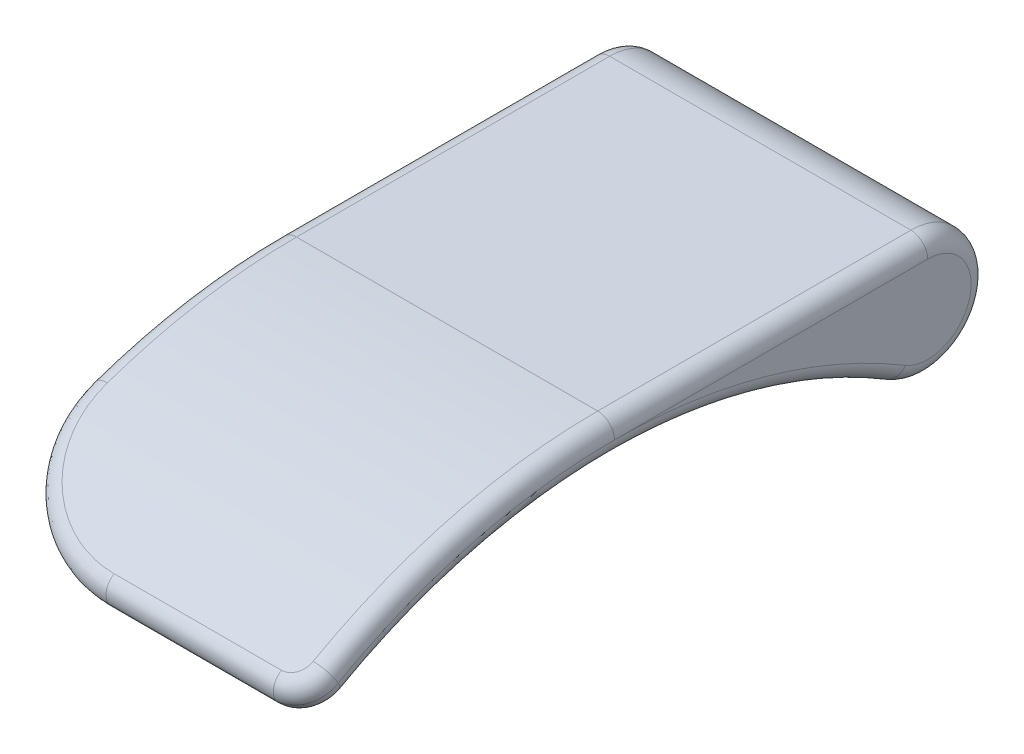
ISO-10303-21;
HEADER;
FILE_DESCRIPTION(('STEP AP214'),'2;1');
FILE_NAME('part.step','',(''),(''),'','','');
FILE_SCHEMA(('AUTOMOTIVE_DESIGN { 1 0 10303 214 1 1 1 1 }'));
ENDSEC;
DATA;
#1=APPLICATION_CONTEXT('core data for automotive mechanical design processes');
#2=APPLICATION_PROTOCOL_DEFINITION('international standard','automotive_design',2000,#1);
#3=PRODUCT_CONTEXT('',#1,'mechanical');
#4=PRODUCT('Part','Part','',(#3));
#5=PRODUCT_RELATED_PRODUCT_CATEGORY('part','',(#4));
#6=PRODUCT_DEFINITION_FORMATION('','',#4);
#7=PRODUCT_DEFINITION_CONTEXT('part definition',#1,'design');
#8=PRODUCT_DEFINITION('design','',#6,#7);
#9=PRODUCT_DEFINITION_SHAPE('','',#8);
#10=(LENGTH_UNIT() NAMED_UNIT(*) SI_UNIT(.MILLI.,.METRE.));
#11=(NAMED_UNIT(*) PLANE_ANGLE_UNIT() SI_UNIT($,.RADIAN.));
#12=(NAMED_UNIT(*) SI_UNIT($,.STERADIAN.) SOLID_ANGLE_UNIT());
#13=UNCERTAINTY_MEASURE_WITH_UNIT(LENGTH_MEASURE(1.E-05),#10,'distance_accuracy_value','');
#14=(GEOMETRIC_REPRESENTATION_CONTEXT(3) GLOBAL_UNCERTAINTY_ASSIGNED_CONTEXT((#13)) GLOBAL_UNIT_ASSIGNED_CONTEXT((#10,
#11,#12)) REPRESENTATION_CONTEXT('',''));
#15=CARTESIAN_POINT('',(0.,0.,0.));
#16=DIRECTION('',(0.,0.,1.));
#17=DIRECTION('',(1.,0.,0.));
#18=AXIS2_PLACEMENT_3D('',#15,#16,#17);
#19=CARTESIAN_POINT('',(-50.,0.,0.));
#20=DIRECTION('',(1.,0.,0.));
#21=DIRECTION('',(0.,0.,-1.));
#22=AXIS2_PLACEMENT_3D('',#19,#20,#21);
#23=CYLINDRICAL_SURFACE('',#22,9.);
#24=DIRECTION('',(1.,0.,0.));
#25=VECTOR('',#24,1.);
#26=CARTESIAN_POINT('',(-50.,9.00000000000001,0.));
#27=LINE('',#26,#25);
#28=CARTESIAN_POINT('',(-47.5,9.00000000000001,0.));
#29=VERTEX_POINT('',#28);
#30=CARTESIAN_POINT('',(-2.5,9.00000000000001,0.));
#31=VERTEX_POINT('',#30);
#32=EDGE_CURVE('E318',#29,#31,#27,.T.);
#33=ORIENTED_EDGE('',*,*,#32,.T.);
#34=CARTESIAN_POINT('',(-2.5,0.,0.));
#35=DIRECTION('',(1.,0.,0.));
#36=DIRECTION('',(0.,0.,-1.));
#37=AXIS2_PLACEMENT_3D('',#34,#35,#36);
#38=CIRCLE('',#37,9.);
#39=CARTESIAN_POINT('',(-2.5,-7.70987062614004,4.64304802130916));
#40=VERTEX_POINT('',#39);
#41=EDGE_CURVE('E321',#31,#40,#38,.F.);
#42=ORIENTED_EDGE('',*,*,#41,.T.);
#43=DIRECTION('',(1.,0.,0.));
#44=VECTOR('',#43,1.);
#45=CARTESIAN_POINT('',(-50.,-7.70987062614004,4.64304802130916));
#46=LINE('',#45,#44);
#47=CARTESIAN_POINT('',(-47.5,-7.70987062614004,4.64304802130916));
#48=VERTEX_POINT('',#47);
#49=EDGE_CURVE('E336',#48,#40,#46,.T.);
#50=ORIENTED_EDGE('',*,*,#49,.F.);
#51=CARTESIAN_POINT('',(-47.5,0.,0.));
#52=DIRECTION('',(1.,0.,0.));
#53=DIRECTION('',(0.,0.,-1.));
#54=AXIS2_PLACEMENT_3D('',#51,#52,#53);
#55=CIRCLE('',#54,9.);
#56=EDGE_CURVE('E324',#48,#29,#55,.T.);
#57=ORIENTED_EDGE('',*,*,#56,.T.);
#58=EDGE_LOOP('',(#33,#42,#50,#57));
#59=FACE_BOUND('',#58,.T.);
#60=ADVANCED_FACE('F48',(#59),#23,.T.);
#61=CARTESIAN_POINT('',(-50.,-77.688579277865,46.7857142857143));
#62=DIRECTION('',(1.,0.,0.));
#63=DIRECTION('',(0.,0.,-1.));
#64=AXIS2_PLACEMENT_3D('',#61,#62,#63);
#65=CYLINDRICAL_SURFACE('',#64,81.688579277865);
#66=ORIENTED_EDGE('',*,*,#49,.T.);
#67=CARTESIAN_POINT('',(-2.5,-77.688579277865,46.7857142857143));
#68=DIRECTION('',(1.,0.,0.));
#69=DIRECTION('',(0.,0.,-1.));
#70=AXIS2_PLACEMENT_3D('',#67,#68,#69);
#71=CIRCLE('',#70,81.688579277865);
#72=CARTESIAN_POINT('',(-2.5,-6.49533960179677,86.8425065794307));
#73=VERTEX_POINT('',#72);
#74=EDGE_CURVE('E509',#40,#73,#71,.T.);
#75=ORIENTED_EDGE('',*,*,#74,.T.);
#76=CARTESIAN_POINT('',(-0.282953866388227,-3.46398586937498,86.6452111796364));
#77=CARTESIAN_POINT('',(-0.227525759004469,-5.69571769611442,85.3961852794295));
#78=CARTESIAN_POINT('',(-2.64147693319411,-6.10351892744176,86.1380092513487));
#79=CARTESIAN_POINT('',(-0.236221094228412,-3.53206431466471,86.7594982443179));
#80=CARTESIAN_POINT('',(-0.185485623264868,-5.75975908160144,85.5140736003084));
#81=CARTESIAN_POINT('',(-2.61811054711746,-6.13466509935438,86.194667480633));
#82=CARTESIAN_POINT('',(-0.195131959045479,-3.60119025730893,86.8753871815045));
#83=CARTESIAN_POINT('',(-0.149134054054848,-5.82476788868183,85.633235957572));
#84=CARTESIAN_POINT('',(-2.5975659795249,-6.16632508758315,86.2520992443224));
#85=CARTESIAN_POINT('',(-0.124474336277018,-3.7411151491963,87.1096415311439));
#86=CARTESIAN_POINT('',(-0.0880164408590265,-5.9562071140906,85.8731121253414));
#87=CARTESIAN_POINT('',(-2.56223716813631,-6.23048379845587,86.3681468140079));
#88=CARTESIAN_POINT('',(-0.094905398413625,-3.81191403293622,87.2280068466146));
#89=CARTESIAN_POINT('',(-0.063223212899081,-6.02264081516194,85.993834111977));
#90=CARTESIAN_POINT('',(-2.54745269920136,-6.26298248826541,86.4267625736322));
#91=CARTESIAN_POINT('',(-0.0238972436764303,-4.02597474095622,87.5853719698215));
#92=CARTESIAN_POINT('',(-0.00643055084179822,-6.22314132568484,86.3565507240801));
#93=CARTESIAN_POINT('',(-2.51194862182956,-6.36135565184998,86.6036658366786));
#94=CARTESIAN_POINT('',(-1.10145377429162E-05,-4.17111342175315,87.8269983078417));
#95=CARTESIAN_POINT('',(0.00836882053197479,-6.35903111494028,86.60024307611));
#96=CARTESIAN_POINT('',(-2.50000550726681,-6.4282045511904,86.7231864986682));
#97=CARTESIAN_POINT('',(1.09947093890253E-05,-4.46170343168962,88.3093790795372));
#98=CARTESIAN_POINT('',(-0.00832587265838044,-6.63094856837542,87.083526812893));
#99=CARTESIAN_POINT('',(-2.49999450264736,-6.56235379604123,86.9616118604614));
#100=CARTESIAN_POINT('',(-0.0237673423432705,-4.60715372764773,88.5501342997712));
#101=CARTESIAN_POINT('',(-0.0395876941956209,-6.76705298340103,87.3232768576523));
#102=CARTESIAN_POINT('',(-2.51188367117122,-6.62965311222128,87.0805172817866));
#103=CARTESIAN_POINT('',(-0.118217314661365,-4.89453737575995,89.024500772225));
#104=CARTESIAN_POINT('',(-0.14687150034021,-7.03612412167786,87.7931897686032));
#105=CARTESIAN_POINT('',(-2.55910865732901,-6.76291649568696,87.3146233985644));
#106=CARTESIAN_POINT('',(-0.188878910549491,-5.03647147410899,89.2581135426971));
#107=CARTESIAN_POINT('',(-0.22279666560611,-7.16918509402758,88.0235292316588));
#108=CARTESIAN_POINT('',(-2.59443945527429,-6.82888084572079,87.4298248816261));
#109=CARTESIAN_POINT('',(-0.375149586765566,-5.3127334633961,89.7116314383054));
#110=CARTESIAN_POINT('',(-0.417195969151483,-7.42857840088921,88.4689661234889));
#111=CARTESIAN_POINT('',(-2.68757479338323,-6.95753693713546,87.6533087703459));
#112=CARTESIAN_POINT('',(-0.49076373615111,-5.44706049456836,89.9315350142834));
#113=CARTESIAN_POINT('',(-0.535647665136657,-7.55500517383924,88.6842329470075));
#114=CARTESIAN_POINT('',(-2.74538186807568,-7.02022830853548,87.7615903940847));
#115=CARTESIAN_POINT('',(-0.763701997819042,-5.70416453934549,90.351435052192));
#116=CARTESIAN_POINT('',(-0.811978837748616,-7.79753883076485,89.0942118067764));
#117=CARTESIAN_POINT('',(-2.88185099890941,-7.14044112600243,87.9682165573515));
#118=CARTESIAN_POINT('',(-0.921030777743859,-5.82694025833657,90.5514292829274));
#119=CARTESIAN_POINT('',(-0.969882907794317,-7.91372840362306,89.2890678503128));
#120=CARTESIAN_POINT('',(-2.9605153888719,-7.19796199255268,88.0665599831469));
#121=CARTESIAN_POINT('',(-1.27271020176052,-6.05712304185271,90.9256078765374));
#122=CARTESIAN_POINT('',(-1.32081727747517,-8.13214649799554,89.6530749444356));
#123=CARTESIAN_POINT('',(-3.13635510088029,-7.30597463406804,88.2504502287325));
#124=CARTESIAN_POINT('',(-1.46701340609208,-6.1645494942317,91.0998248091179));
#125=CARTESIAN_POINT('',(-1.51385051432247,-8.23445653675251,89.8223672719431));
#126=CARTESIAN_POINT('',(-3.23350670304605,-7.35647527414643,88.3360131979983));
#127=CARTESIAN_POINT('',(-1.88730413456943,-6.36101823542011,91.4179018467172));
#128=CARTESIAN_POINT('',(-1.93022313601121,-8.42207540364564,90.131229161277));
#129=CARTESIAN_POINT('',(-3.44365206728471,-7.44895406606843,88.4921561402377));
#130=CARTESIAN_POINT('',(-2.11329656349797,-6.45005767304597,91.5617572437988));
#131=CARTESIAN_POINT('',(-2.15362280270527,-8.50742338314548,90.2708638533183));
#132=CARTESIAN_POINT('',(-3.55664828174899,-7.49093089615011,88.5627337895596));
#133=CARTESIAN_POINT('',(-2.59039129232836,-6.607009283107,91.8150055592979));
#134=CARTESIAN_POINT('',(-2.62466382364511,-8.65822765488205,90.5166322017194));
#135=CARTESIAN_POINT('',(-3.79519564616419,-7.56499683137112,88.6869363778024));
#136=CARTESIAN_POINT('',(-2.84148347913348,-6.67492991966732,91.9244122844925));
#137=CARTESIAN_POINT('',(-2.87234155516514,-8.72371389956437,90.6228153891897));
#138=CARTESIAN_POINT('',(-3.92074173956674,-7.59708989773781,88.7405681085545));
#139=CARTESIAN_POINT('',(-3.36158282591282,-6.7875844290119,92.105722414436));
#140=CARTESIAN_POINT('',(-3.38515246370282,-8.83251931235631,90.7987921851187));
#141=CARTESIAN_POINT('',(-4.18079141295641,-7.65035410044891,88.8294261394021));
#142=CARTESIAN_POINT('',(-3.63057207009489,-6.83234110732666,92.1776627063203));
#143=CARTESIAN_POINT('',(-3.65029572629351,-8.87586851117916,90.8686349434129));
#144=CARTESIAN_POINT('',(-4.31528603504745,-7.67153597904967,88.8646705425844));
#145=CARTESIAN_POINT('',(-4.08422303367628,-6.88618095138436,92.2641682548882));
#146=CARTESIAN_POINT('',(-4.09742541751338,-8.92806122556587,90.9526257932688));
#147=CARTESIAN_POINT('',(-4.54211151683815,-7.69702428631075,88.9070458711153));
#148=CARTESIAN_POINT('',(-4.26602068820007,-6.9022414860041,92.2899606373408));
#149=CARTESIAN_POINT('',(-4.27660336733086,-8.94364732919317,90.9776718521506));
#150=CARTESIAN_POINT('',(-4.63301034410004,-7.70463023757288,88.9196787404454));
#151=CARTESIAN_POINT('',(-4.6318393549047,-6.92369031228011,92.3244023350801));
#152=CARTESIAN_POINT('',(-4.63714807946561,-8.96446803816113,91.0111181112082));
#153=CARTESIAN_POINT('',(-4.81591967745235,-7.71478886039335,88.9365474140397));
#154=CARTESIAN_POINT('',(-4.81586039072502,-6.92907849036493,92.3330514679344));
#155=CARTESIAN_POINT('',(-4.81851555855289,-8.96970258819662,91.0195182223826));
#156=CARTESIAN_POINT('',(-4.90793019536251,-7.71734147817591,88.9407831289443));
#157=CARTESIAN_POINT('',(-5.28038702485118,-6.92906010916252,92.3330230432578));
#158=CARTESIAN_POINT('',(-5.27634397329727,-8.96968322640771,91.0194902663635));
#159=CARTESIAN_POINT('',(-5.14019351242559,-7.71733253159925,88.9407693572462));
#160=CARTESIAN_POINT('',(-5.56104897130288,-6.91653921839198,92.3129260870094));
#161=CARTESIAN_POINT('',(-5.55295839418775,-8.95751705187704,90.9999714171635));
#162=CARTESIAN_POINT('',(-5.28052448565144,-7.7114004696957,88.9309275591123));
#163=CARTESIAN_POINT('',(-5.97624471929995,-6.87927243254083,92.2530675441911));
#164=CARTESIAN_POINT('',(-5.96217243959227,-8.92136504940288,90.9418481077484));
#165=CARTESIAN_POINT('',(-5.48812235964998,-7.693753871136,88.901608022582));
#166=CARTESIAN_POINT('',(-6.11399024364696,-6.86371145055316,92.2280696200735));
#167=CARTESIAN_POINT('',(-6.09793589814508,-8.90627440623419,90.9175757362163));
#168=CARTESIAN_POINT('',(-5.55699512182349,-7.68638621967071,88.8893631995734));
#169=CARTESIAN_POINT('',(-6.38656210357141,-6.82651406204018,92.1682883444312));
#170=CARTESIAN_POINT('',(-6.36659698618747,-8.8702360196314,90.8595364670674));
#171=CARTESIAN_POINT('',(-5.69328105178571,-7.66878003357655,88.8600768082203));
#172=CARTESIAN_POINT('',(-6.52138725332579,-6.80487523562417,92.1335010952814));
#173=CARTESIAN_POINT('',(-6.49949516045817,-8.84928563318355,90.8257652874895));
#174=CARTESIAN_POINT('',(-5.7606936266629,-7.65854035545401,88.8430333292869));
#175=CARTESIAN_POINT('',(-6.65432122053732,-6.78026609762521,92.0939194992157));
#176=CARTESIAN_POINT('',(-6.63054034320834,-8.82548508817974,90.7873443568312));
#177=CARTESIAN_POINT('',(-5.82716061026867,-7.6468993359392,88.8236382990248));
#178=(BOUNDED_SURFACE() B_SPLINE_SURFACE(3,2,((#76,#77,#78),(#79,#80,#81),(#82,#83,#84),(#85,
#86,#87),(#88,#89,#90),(#91,#92,#93),(#94,#95,#96),(#97,#98,#99),(#100,#101,#102),(#103,#104,
#105),(#106,#107,#108),(#109,#110,#111),(#112,#113,#114),(#115,#116,#117),(#118,#119,#120),
(#121,#122,#123),(#124,#125,#126),(#127,#128,#129),(#130,#131,#132),(#133,#134,#135),(#136,#137,
#138),(#139,#140,#141),(#142,#143,#144),(#145,#146,#147),(#148,#149,#150),(#151,#152,#153),
(#154,#155,#156),(#157,#158,#159),(#160,#161,#162),(#163,#164,#165),(#166,#167,#168),(#169,#170,
#171),(#172,#173,#174),(#175,#176,#177)),.UNSPECIFIED.,.F.,.F.,
.F.) B_SPLINE_SURFACE_WITH_KNOTS((4,2,2,2,2,2,2,2,2,2,2,2,2,2,2,2,4),(3,3),(0.,
0.211704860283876,0.423401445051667,0.84614093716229,1.2681194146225,1.69000756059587,
2.11194329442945,2.53392626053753,2.95537141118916,3.37688186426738,3.79822316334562,
4.21914884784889,4.49510237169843,4.77105883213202,5.19125420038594,5.4023347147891,
5.61349939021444),(0.,1.),
.UNSPECIFIED.) GEOMETRIC_REPRESENTATION_ITEM() RATIONAL_B_SPLINE_SURFACE(((1.,0.698941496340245,
1.),(1.,0.699693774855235,1.),(1.,0.700432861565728,1.),(1.,0.701877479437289,1.),(1.,
0.702583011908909,1.),(1.,0.704636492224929,1.),(1.,0.705923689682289,1.),(1.,0.708287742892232,
1.),(1.,0.709364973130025,1.),(1.,0.711293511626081,1.),(1.,0.712144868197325,1.),(1.,
0.713624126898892,1.),(1.,0.714252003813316,1.),(1.,0.715305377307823,1.),(1.,0.715730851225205,
1.),(1.,0.71641391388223,1.),(1.,0.716671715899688,1.),(1.,0.717063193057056,1.),(1.,
0.717196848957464,1.),(1.,0.717384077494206,1.),(1.,0.717437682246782,1.),(1.,0.717503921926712,
1.),(1.,0.717516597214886,1.),(1.,0.717526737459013,1.),(1.,0.717527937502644,1.),(1.,
0.717528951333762,1.),(1.,0.717528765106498,1.),(1.,0.717528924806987,1.),(1.,0.717529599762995,
1.),(1.,0.717525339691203,1.),(1.,0.717523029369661,1.),(1.,0.717513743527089,1.),(1.,
0.71750676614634,1.),(1.,0.717496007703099,1.))) REPRESENTATION_ITEM('') SURFACE());
#179=CARTESIAN_POINT('',(-2.64147693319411,-6.10351892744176,86.1380092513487));
#180=CARTESIAN_POINT('',(-2.61811054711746,-6.13466509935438,86.194667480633));
#181=CARTESIAN_POINT('',(-2.5975659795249,-6.16632508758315,86.2520992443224));
#182=CARTESIAN_POINT('',(-2.56223716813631,-6.23048379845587,86.3681468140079));
#183=CARTESIAN_POINT('',(-2.54745269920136,-6.26298248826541,86.4267625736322));
#184=CARTESIAN_POINT('',(-2.51194862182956,-6.36135565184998,86.6036658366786));
#185=CARTESIAN_POINT('',(-2.50000550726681,-6.4282045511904,86.7231864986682));
#186=CARTESIAN_POINT('',(-2.49999450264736,-6.56235379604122,86.9616118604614));
#187=CARTESIAN_POINT('',(-2.51188367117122,-6.62965311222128,87.0805172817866));
#188=CARTESIAN_POINT('',(-2.55910865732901,-6.76291649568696,87.3146233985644));
#189=CARTESIAN_POINT('',(-2.59443945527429,-6.82888084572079,87.4298248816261));
#190=CARTESIAN_POINT('',(-2.68757479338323,-6.95753693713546,87.6533087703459));
#191=CARTESIAN_POINT('',(-2.74538186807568,-7.02022830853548,87.7615903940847));
#192=CARTESIAN_POINT('',(-2.88185099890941,-7.14044112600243,87.9682165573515));
#193=CARTESIAN_POINT('',(-2.9605153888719,-7.19796199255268,88.0665599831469));
#194=CARTESIAN_POINT('',(-3.13635510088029,-7.30597463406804,88.2504502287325));
#195=CARTESIAN_POINT('',(-3.23350670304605,-7.35647527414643,88.3360131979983));
#196=CARTESIAN_POINT('',(-3.44365206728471,-7.44895406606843,88.4921561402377));
#197=CARTESIAN_POINT('',(-3.55664828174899,-7.49093089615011,88.5627337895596));
#198=CARTESIAN_POINT('',(-3.79519564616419,-7.56499683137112,88.6869363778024));
#199=CARTESIAN_POINT('',(-3.92074173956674,-7.59708989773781,88.7405681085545));
#200=CARTESIAN_POINT('',(-4.18079141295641,-7.65035410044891,88.8294261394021));
#201=CARTESIAN_POINT('',(-4.31528603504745,-7.67153597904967,88.8646705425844));
#202=CARTESIAN_POINT('',(-4.54211151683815,-7.69702428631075,88.9070458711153));
#203=CARTESIAN_POINT('',(-4.63301034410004,-7.70463023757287,88.9196787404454));
#204=CARTESIAN_POINT('',(-4.81591967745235,-7.71478886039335,88.9365474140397));
#205=CARTESIAN_POINT('',(-4.90793019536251,-7.71734147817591,88.9407831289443));
#206=CARTESIAN_POINT('',(-5.14019351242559,-7.71733253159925,88.9407693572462));
#207=CARTESIAN_POINT('',(-5.28052448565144,-7.7114004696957,88.9309275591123));
#208=CARTESIAN_POINT('',(-5.48812235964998,-7.693753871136,88.901608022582));
#209=CARTESIAN_POINT('',(-5.55699512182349,-7.68638621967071,88.8893631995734));
#210=CARTESIAN_POINT('',(-5.69328105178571,-7.66878003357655,88.8600768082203));
#211=CARTESIAN_POINT('',(-5.7606936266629,-7.65854035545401,88.8430333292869));
#212=CARTESIAN_POINT('',(-5.82716061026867,-7.6468993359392,88.8236382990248));
#213=B_SPLINE_CURVE_WITH_KNOTS('',3,(#179,#180,#181,#182,#183,#184,#185,#186,#187,#188,#189,
#190,#191,#192,#193,#194,#195,#196,#197,#198,#199,#200,#201,#202,#203,#204,#205,#206,#207,#208,
#209,#210,#211,#212),.UNSPECIFIED.,.F.,.F.,(4,2,2,2,2,2,2,2,2,2,2,2,2,2,2,2,4),(0.,
0.211704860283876,0.423401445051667,0.84614093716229,1.2681194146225,1.69000756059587,
2.11194329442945,2.53392626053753,2.95537141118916,3.37688186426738,3.79822316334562,
4.21914884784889,4.49510237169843,4.77105883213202,5.19125420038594,5.4023347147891,
5.61349939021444),.UNSPECIFIED.);
#214=CARTESIAN_POINT('',(-5.,-7.7173379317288,88.9407776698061));
#215=VERTEX_POINT('',#214);
#216=EDGE_CURVE('E379',#73,#215,#213,.T.);
#217=ORIENTED_EDGE('',*,*,#216,.T.);
#218=DIRECTION('',(1.,0.,0.));
#219=VECTOR('',#218,1.);
#220=CARTESIAN_POINT('',(-50.,-7.7173379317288,88.9407776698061));
#221=LINE('',#220,#219);
#222=CARTESIAN_POINT('',(-30.,-7.7173379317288,88.9407776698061));
#223=VERTEX_POINT('',#222);
#224=EDGE_CURVE('E371',#215,#223,#221,.F.);
#225=ORIENTED_EDGE('',*,*,#224,.T.);
#226=CARTESIAN_POINT('',(-23.388669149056,-6.34993168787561,91.3686876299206));
#227=CARTESIAN_POINT('',(-23.4197314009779,-8.37722228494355,90.0766758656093));
#228=CARTESIAN_POINT('',(-24.2150855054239,-7.22920683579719,88.1197295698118));
#229=CARTESIAN_POINT('',(-23.9187642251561,-6.44482517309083,91.5284915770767));
#230=CARTESIAN_POINT('',(-23.9466340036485,-8.47393579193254,90.2327963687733));
#231=CARTESIAN_POINT('',(-24.6789186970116,-7.3090894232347,88.2558457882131));
#232=CARTESIAN_POINT('',(-24.4567285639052,-6.52860583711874,91.6687594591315));
#233=CARTESIAN_POINT('',(-24.4812388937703,-8.55943962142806,90.3698050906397));
#234=CARTESIAN_POINT('',(-25.149637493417,-7.37966244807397,88.3752948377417));
#235=CARTESIAN_POINT('',(-25.5444729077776,-6.67306542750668,91.9096967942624));
#236=CARTESIAN_POINT('',(-25.5629983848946,-8.70713074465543,90.605320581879));
#237=CARTESIAN_POINT('',(-26.1014137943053,-7.50139947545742,88.5804414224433));
#238=CARTESIAN_POINT('',(-26.0942522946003,-6.73374555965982,92.0103683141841));
#239=CARTESIAN_POINT('',(-26.1100028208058,-8.76927083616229,90.7037506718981));
#240=CARTESIAN_POINT('',(-26.5824707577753,-7.55256449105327,88.6661407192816));
#241=CARTESIAN_POINT('',(-27.2013774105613,-6.83110443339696,92.1715477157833));
#242=CARTESIAN_POINT('',(-27.2121827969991,-8.86909452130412,90.8614453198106));
#243=CARTESIAN_POINT('',(-27.5512052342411,-7.63467572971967,88.8033375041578));
#244=CARTESIAN_POINT('',(-27.7587176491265,-6.86779973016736,92.232083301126));
#245=CARTESIAN_POINT('',(-27.7671587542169,-8.90675765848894,90.9206775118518));
#246=CARTESIAN_POINT('',(-28.0388779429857,-7.66563589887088,88.8548585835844));
#247=CARTESIAN_POINT('',(-28.8773718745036,-6.91678284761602,92.3128292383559));
#248=CARTESIAN_POINT('',(-28.8815318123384,-8.9570676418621,90.9997239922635));
#249=CARTESIAN_POINT('',(-29.0177003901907,-7.70696676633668,88.9235784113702));
#250=CARTESIAN_POINT('',(-29.4386858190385,-6.92907092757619,92.3330400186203));
#251=CARTESIAN_POINT('',(-29.4407085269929,-8.96969459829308,91.0195069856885));
#252=CARTESIAN_POINT('',(-29.5088500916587,-7.7173376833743,88.9407775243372));
#253=CARTESIAN_POINT('',(-30.5615656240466,-6.92907148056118,92.3330403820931));
#254=CARTESIAN_POINT('',(-30.5595420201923,-8.96969522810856,91.0195072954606));
#255=CARTESIAN_POINT('',(-30.4913699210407,-7.71733818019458,88.9407778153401));
#256=CARTESIAN_POINT('',(-31.1231314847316,-6.91677294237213,92.312811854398));
#257=CARTESIAN_POINT('',(-31.1189688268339,-8.95705758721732,90.9997068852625));
#258=CARTESIAN_POINT('',(-30.9827400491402,-7.70695846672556,88.9235635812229));
#259=CARTESIAN_POINT('',(-32.2422860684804,-6.86774362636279,92.2319918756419));
#260=CARTESIAN_POINT('',(-32.2338415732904,-8.90669993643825,90.92058813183));
#261=CARTESIAN_POINT('',(-31.9620003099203,-7.66558850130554,88.8547808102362));
#262=CARTESIAN_POINT('',(-32.7998747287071,-6.83101246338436,92.1713997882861));
#263=CARTESIAN_POINT('',(-32.7890666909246,-8.86899973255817,90.8613009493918));
#264=CARTESIAN_POINT('',(-32.4498903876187,-7.63459792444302,88.8032117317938));
#265=CARTESIAN_POINT('',(-33.9070046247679,-6.73361685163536,92.0101508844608));
#266=CARTESIAN_POINT('',(-33.8912454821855,-8.76913938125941,90.703537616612));
#267=CARTESIAN_POINT('',(-33.4186290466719,-7.55245618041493,88.6659554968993));
#268=CARTESIAN_POINT('',(-34.4565473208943,-6.67295680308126,91.9095014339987));
#269=CARTESIAN_POINT('',(-34.4380070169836,-8.70702105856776,90.6051280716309));
#270=CARTESIAN_POINT('',(-33.8994789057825,-7.50130871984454,88.5802746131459));
#271=CARTESIAN_POINT('',(-35.5437827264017,-6.52851100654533,91.6686155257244));
#272=CARTESIAN_POINT('',(-35.5192787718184,-8.55934133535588,90.3696659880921));
#273=CARTESIAN_POINT('',(-34.8508098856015,-7.37958174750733,88.3751727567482));
#274=CARTESIAN_POINT('',(-36.0814754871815,-6.44472535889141,91.5283792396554));
#275=CARTESIAN_POINT('',(-36.0536379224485,-8.4738287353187,90.2326926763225));
#276=CARTESIAN_POINT('',(-35.3212910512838,-7.30900232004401,88.255751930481));
#277=CARTESIAN_POINT('',(-37.1411764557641,-6.25513976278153,91.2089989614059));
#278=CARTESIAN_POINT('',(-37.106162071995,-8.28075106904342,89.9208774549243));
#279=CARTESIAN_POINT('',(-36.2485293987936,-7.14941282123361,87.9837097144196));
#280=CARTESIAN_POINT('',(-37.6631849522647,-6.14934021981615,91.0298556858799));
#281=CARTESIAN_POINT('',(-37.6242301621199,-8.1732387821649,89.7461239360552));
#282=CARTESIAN_POINT('',(-36.7052868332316,-7.06040308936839,87.831088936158));
#283=CARTESIAN_POINT('',(-38.6879707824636,-5.91708071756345,90.6334797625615));
#284=CARTESIAN_POINT('',(-38.6406017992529,-7.93784320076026,89.3596762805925));
#285=CARTESIAN_POINT('',(-37.6019744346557,-6.86517338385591,87.4932959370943));
#286=CARTESIAN_POINT('',(-39.1907417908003,-5.79061403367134,90.4162347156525));
#287=CARTESIAN_POINT('',(-39.1388625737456,-7.81000055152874,89.1480531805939));
#288=CARTESIAN_POINT('',(-38.0418990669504,-6.75894780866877,87.3081131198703));
#289=CARTESIAN_POINT('',(-40.1732438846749,-5.51870649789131,89.9448144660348));
#290=CARTESIAN_POINT('',(-40.1118855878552,-7.535984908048,88.6891286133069));
#291=CARTESIAN_POINT('',(-38.9015883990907,-6.53079868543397,86.9061283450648));
#292=CARTESIAN_POINT('',(-40.6529763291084,-5.37326676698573,89.6906414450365));
#293=CARTESIAN_POINT('',(-40.5866749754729,-7.3898464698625,88.4418934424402));
#294=CARTESIAN_POINT('',(-39.3213542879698,-6.4088760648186,86.6893282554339));
#295=CARTESIAN_POINT('',(-41.5859863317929,-5.06529341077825,89.1466958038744));
#296=CARTESIAN_POINT('',(-41.5095087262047,-7.08147465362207,87.9131595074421));
#297=CARTESIAN_POINT('',(-40.1377380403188,-6.15101703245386,86.2251820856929));
#298=CARTESIAN_POINT('',(-42.0392640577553,-4.90275989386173,88.8569234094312));
#299=CARTESIAN_POINT('',(-41.9576377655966,-6.91925309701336,87.6316916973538));
#300=CARTESIAN_POINT('',(-40.5343560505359,-6.0150807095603,85.9778361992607));
#301=CARTESIAN_POINT('',(-42.9150471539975,-4.56309506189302,88.2441071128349));
#302=CARTESIAN_POINT('',(-42.8231039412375,-6.58154307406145,87.0368457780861));
#303=CARTESIAN_POINT('',(-41.3006662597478,-5.73139904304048,85.4545199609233));
#304=CARTESIAN_POINT('',(-43.3376242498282,-4.3859999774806,87.92114531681));
#305=CARTESIAN_POINT('',(-43.2406453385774,-6.40607216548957,86.7235314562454));
#306=CARTESIAN_POINT('',(-41.6704212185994,-5.58368303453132,85.1786202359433));
#307=CARTESIAN_POINT('',(-44.150053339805,-4.01916755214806,87.2433205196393));
#308=CARTESIAN_POINT('',(-44.043299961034,-6.04410823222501,86.0663735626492));
#309=CARTESIAN_POINT('',(-42.3812966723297,-5.27819434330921,84.5993004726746));
#310=CARTESIAN_POINT('',(-44.5399162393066,-3.82943446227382,86.8884682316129));
#311=CARTESIAN_POINT('',(-44.428594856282,-5.85757169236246,85.7224667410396));
#312=CARTESIAN_POINT('',(-42.7224267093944,-5.12042504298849,84.2958896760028));
#313=CARTESIAN_POINT('',(-45.2843926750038,-3.43958157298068,86.1487864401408));
#314=CARTESIAN_POINT('',(-45.1646117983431,-5.47597309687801,85.0059916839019));
#315=CARTESIAN_POINT('',(-43.3738435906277,-4.79683198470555,83.6631251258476));
#316=CARTESIAN_POINT('',(-45.638998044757,-3.23945938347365,85.7639500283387));
#317=CARTESIAN_POINT('',(-45.5155188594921,-5.28082939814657,84.6332769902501));
#318=CARTESIAN_POINT('',(-43.6841232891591,-4.63100637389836,83.3337653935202));
#319=CARTESIAN_POINT('',(-46.3103706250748,-2.83130516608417,84.9667521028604));
#320=CARTESIAN_POINT('',(-46.1805886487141,-4.8846706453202,83.8615073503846));
#321=CARTESIAN_POINT('',(-44.2715742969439,-4.29348065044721,82.6511352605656));
#322=CARTESIAN_POINT('',(-46.6271384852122,-2.62327327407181,84.5543910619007));
#323=CARTESIAN_POINT('',(-46.4949494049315,-4.68354539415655,83.4622418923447));
#324=CARTESIAN_POINT('',(-44.5487461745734,-4.12178063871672,82.2978652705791));
#325=CARTESIAN_POINT('',(-47.2188635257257,-2.20305590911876,83.7073896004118));
#326=CARTESIAN_POINT('',(-47.0833895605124,-4.27924051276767,82.6423347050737));
#327=CARTESIAN_POINT('',(-45.0665055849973,-3.77572779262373,81.5718473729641));
#328=CARTESIAN_POINT('',(-47.494065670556,-1.99090381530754,83.2729016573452));
#329=CARTESIAN_POINT('',(-47.3578860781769,-4.07594608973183,82.221559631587));
#330=CARTESIAN_POINT('',(-45.3073074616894,-3.60139774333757,81.1992324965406));
#331=CARTESIAN_POINT('',(-48.0032132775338,-1.56361588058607,82.382176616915));
#332=CARTESIAN_POINT('',(-47.8675308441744,-3.66853301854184,81.3589660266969));
#333=CARTESIAN_POINT('',(-45.7528116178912,-3.25114908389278,80.4349292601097));
#334=CARTESIAN_POINT('',(-48.2371589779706,-1.34848005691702,81.9259396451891));
#335=CARTESIAN_POINT('',(-48.1028287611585,-3.46426076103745,80.9168019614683));
#336=CARTESIAN_POINT('',(-45.9575141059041,-3.07523048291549,80.0432410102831));
#337=CARTESIAN_POINT('',(-48.6622534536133,-0.917706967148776,80.995095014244));
#338=CARTESIAN_POINT('',(-48.5329048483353,-3.05734089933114,80.0144657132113));
#339=CARTESIAN_POINT('',(-46.3294717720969,-2.72393861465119,79.2436424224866));
#340=CARTESIAN_POINT('',(-48.8534347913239,-0.702070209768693,80.5205016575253));
#341=CARTESIAN_POINT('',(-48.7278169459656,-2.85452683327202,79.5539010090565));
#342=CARTESIAN_POINT('',(-46.4967554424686,-2.54856503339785,78.8357447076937));
#343=CARTESIAN_POINT('',(-49.1922068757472,-0.272394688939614,79.5559796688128));
#344=CARTESIAN_POINT('',(-49.0766465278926,-2.45253627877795,78.6174083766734));
#345=CARTESIAN_POINT('',(-46.7931810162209,-2.20015814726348,78.0062962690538));
#346=CARTESIAN_POINT('',(-49.3398058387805,-0.0583556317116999,79.0660539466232));
#347=CARTESIAN_POINT('',(-49.2306148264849,-2.25319124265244,78.1410276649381));
#348=CARTESIAN_POINT('',(-46.922330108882,-2.02712440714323,77.5847481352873));
#349=CARTESIAN_POINT('',(-49.6437563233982,0.455600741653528,77.8649901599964));
#350=CARTESIAN_POINT('',(-49.553661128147,-1.77677002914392,76.9712924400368));
#351=CARTESIAN_POINT('',(-47.1882867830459,-1.61299129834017,76.550719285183));
#352=CARTESIAN_POINT('',(-49.7776312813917,0.753735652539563,77.1475579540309));
#353=CARTESIAN_POINT('',(-49.7013862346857,-1.50241981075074,76.2710783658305));
#354=CARTESIAN_POINT('',(-47.3054273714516,-1.37390551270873,75.9325727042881));
#355=CARTESIAN_POINT('',(-49.9557428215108,1.33756847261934,75.6980293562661));
#356=CARTESIAN_POINT('',(-49.9133920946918,-0.96962719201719,74.8540129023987));
#357=CARTESIAN_POINT('',(-47.4612749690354,-0.908169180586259,74.6826218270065));
#358=CARTESIAN_POINT('',(-49.9999920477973,1.62326813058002,74.9659350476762));
#359=CARTESIAN_POINT('',(-49.9772938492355,-0.710778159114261,74.1356665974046));
#360=CARTESIAN_POINT('',(-47.4999930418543,-0.681516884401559,74.050819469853));
#361=CARTESIAN_POINT('',(-50.000006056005,2.11191261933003,73.6721358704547));
#362=CARTESIAN_POINT('',(-50.0174312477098,-0.272357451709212,72.8643347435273));
#363=CARTESIAN_POINT('',(-47.5000052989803,-0.296163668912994,72.9333644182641));
#364=CARTESIAN_POINT('',(-49.9743539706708,2.31834594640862,73.1114272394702));
#365=CARTESIAN_POINT('',(-50.0106123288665,-0.0880820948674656,72.3109626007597));
#366=CARTESIAN_POINT('',(-47.4775597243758,-0.134146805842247,72.4487855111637));
#367=CARTESIAN_POINT('',(-49.8726280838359,2.72033154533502,71.9910109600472));
#368=CARTESIAN_POINT('',(-49.949974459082,0.268324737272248,71.2022128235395));
#369=CARTESIAN_POINT('',(-47.3885495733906,0.179770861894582,71.4799124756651));
#370=CARTESIAN_POINT('',(-49.796533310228,2.91587925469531,71.4313038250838));
#371=CARTESIAN_POINT('',(-49.8957179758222,0.440543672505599,70.6462204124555));
#372=CARTESIAN_POINT('',(-47.3219666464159,0.331667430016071,70.9956185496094));
#373=CARTESIAN_POINT('',(-49.5947926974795,3.29538418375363,70.3157437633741));
#374=CARTESIAN_POINT('',(-49.7407811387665,0.772380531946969,69.5343616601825));
#375=CARTESIAN_POINT('',(-47.1454436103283,0.624838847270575,70.0298001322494));
#376=CARTESIAN_POINT('',(-49.4690101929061,3.47930779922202,69.7599058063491));
#377=CARTESIAN_POINT('',(-49.6394581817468,0.932006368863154,68.9779546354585));
#378=CARTESIAN_POINT('',(-47.0353839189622,0.766083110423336,69.5482870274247));
#379=CARTESIAN_POINT('',(-49.1694342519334,3.83415665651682,68.6579084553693));
#380=CARTESIAN_POINT('',(-49.3913557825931,1.23768843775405,67.8702335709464));
#381=CARTESIAN_POINT('',(-46.7732549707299,1.03695537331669,68.593104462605));
#382=CARTESIAN_POINT('',(-48.9956661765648,4.00508870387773,68.1117441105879));
#383=CARTESIAN_POINT('',(-49.2440023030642,1.38375540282,67.3184393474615));
#384=CARTESIAN_POINT('',(-46.6212079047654,1.16658946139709,68.1194309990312));
#385=CARTESIAN_POINT('',(-48.798605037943,4.16921465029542,67.5722460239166));
#386=CARTESIAN_POINT('',(-49.0752179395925,1.5219908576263,66.7740318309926));
#387=CARTESIAN_POINT('',(-46.4487794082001,1.29022937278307,67.6512784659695));
#388=(BOUNDED_SURFACE() B_SPLINE_SURFACE(3,2,((#226,#227,#228),(#229,#230,#231),(#232,#233,
#234),(#235,#236,#237),(#238,#239,#240),(#241,#242,#243),(#244,#245,#246),(#247,#248,#249),
(#250,#251,#252),(#253,#254,#255),(#256,#257,#258),(#259,#260,#261),(#262,#263,#264),(#265,#266,
#267),(#268,#269,#270),(#271,#272,#273),(#274,#275,#276),(#277,#278,#279),(#280,#281,#282),
(#283,#284,#285),(#286,#287,#288),(#289,#290,#291),(#292,#293,#294),(#295,#296,#297),(#298,#299,
#300),(#301,#302,#303),(#304,#305,#306),(#307,#308,#309),(#310,#311,#312),(#313,#314,#315),
(#316,#317,#318),(#319,#320,#321),(#322,#323,#324),(#325,#326,#327),(#328,#329,#330),(#331,#332,
#333),(#334,#335,#336),(#337,#338,#339),(#340,#341,#342),(#343,#344,#345),(#346,#347,#348),
(#349,#350,#351),(#352,#353,#354),(#355,#356,#357),(#358,#359,#360),(#361,#362,#363),(#364,#365,
#366),(#367,#368,#369),(#370,#371,#372),(#373,#374,#375),(#376,#377,#378),(#379,#380,#381),
(#382,#383,#384),(#385,#386,#387)),.UNSPECIFIED.,.F.,.F.,.F.) B_SPLINE_SURFACE_WITH_KNOTS((4,2,
2,2,2,2,2,2,2,2,2,2,2,2,2,2,2,2,2,2,2,2,2,2,2,2,4),(3,3),(0.,1.47412564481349,2.94817433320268,
4.42120450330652,5.8942190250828,7.36789339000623,8.84159098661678,10.3150177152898,
11.7884380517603,13.2618312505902,14.7357048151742,16.2094913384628,17.683268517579,
19.1534837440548,20.6232069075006,22.0932697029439,23.5633072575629,25.0243114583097,
26.4853072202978,27.9451867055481,29.4047907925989,31.4788983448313,33.5527132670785,
35.1320283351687,36.7120004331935,38.2963488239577,39.8798614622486),(0.,1.),
.UNSPECIFIED.) GEOMETRIC_REPRESENTATION_ITEM() RATIONAL_B_SPLINE_SURFACE(((1.,0.720782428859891,
1.),(1.,0.720282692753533,1.),(1.,0.719826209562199,1.),(1.,0.719021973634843,1.),(1.,
0.718674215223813,1.),(1.,0.71810979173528,1.),(1.,0.717893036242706,1.),(1.,0.717602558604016,
1.),(1.,0.717528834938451,1.),(1.,0.717528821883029,1.),(1.,0.71760259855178,1.),(1.,
0.717893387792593,1.),(1.,0.718110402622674,1.),(1.,0.718674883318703,1.),(1.,0.719022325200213,
1.),(1.,0.71982699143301,1.),(1.,0.720284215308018,1.),(1.,0.721280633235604,1.),(1.,
0.721819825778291,1.),(1.,0.722946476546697,1.),(1.,0.723533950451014,1.),(1.,0.724718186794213,
1.),(1.,0.725314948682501,1.),(1.,0.726475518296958,1.),(1.,0.72703932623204,1.),(1.,
0.728088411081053,1.),(1.,0.728573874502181,1.),(1.,0.729423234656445,1.),(1.,0.729787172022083,
1.),(1.,0.730350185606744,1.),(1.,0.730549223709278,1.),(1.,0.73074099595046,1.),(1.,
0.730733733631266,1.),(1.,0.730476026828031,1.),(1.,0.730227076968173,1.),(1.,0.729455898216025,
1.),(1.,0.728933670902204,1.),(1.,0.727589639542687,1.),(1.,0.726768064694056,1.),(1.,
0.724805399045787,1.),(1.,0.723664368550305,1.),(1.,0.720497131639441,1.),(1.,0.718300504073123,
1.),(1.,0.713217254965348,1.),(1.,0.710330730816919,1.),(1.,0.704651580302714,1.),(1.,
0.702000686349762,1.),(1.,0.696321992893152,1.),(1.,0.693294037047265,1.),(1.,0.686877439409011,
1.),(1.,0.683487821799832,1.),(1.,0.676391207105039,1.),(1.,0.672684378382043,1.),(1.,
0.668835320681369,1.))) REPRESENTATION_ITEM('') SURFACE());
#389=CARTESIAN_POINT('',(-24.2150855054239,-7.22920683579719,88.1197295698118));
#390=CARTESIAN_POINT('',(-24.6789186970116,-7.3090894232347,88.2558457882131));
#391=CARTESIAN_POINT('',(-25.149637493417,-7.37966244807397,88.3752948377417));
#392=CARTESIAN_POINT('',(-26.1014137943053,-7.50139947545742,88.5804414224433));
#393=CARTESIAN_POINT('',(-26.5824707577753,-7.55256449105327,88.6661407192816));
#394=CARTESIAN_POINT('',(-27.5512052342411,-7.63467572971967,88.8033375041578));
#395=CARTESIAN_POINT('',(-28.0388779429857,-7.66563589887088,88.8548585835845));
#396=CARTESIAN_POINT('',(-29.0177003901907,-7.70696676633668,88.9235784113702));
#397=CARTESIAN_POINT('',(-29.5088500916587,-7.7173376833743,88.9407775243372));
#398=CARTESIAN_POINT('',(-30.4913699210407,-7.71733818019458,88.9407778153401));
#399=CARTESIAN_POINT('',(-30.9827400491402,-7.70695846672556,88.9235635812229));
#400=CARTESIAN_POINT('',(-31.9620003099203,-7.66558850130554,88.8547808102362));
#401=CARTESIAN_POINT('',(-32.4498903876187,-7.63459792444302,88.8032117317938));
#402=CARTESIAN_POINT('',(-33.4186290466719,-7.55245618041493,88.6659554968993));
#403=CARTESIAN_POINT('',(-33.8994789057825,-7.50130871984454,88.5802746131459));
#404=CARTESIAN_POINT('',(-34.8508098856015,-7.37958174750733,88.3751727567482));
#405=CARTESIAN_POINT('',(-35.3212910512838,-7.30900232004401,88.255751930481));
#406=CARTESIAN_POINT('',(-36.2485293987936,-7.14941282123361,87.9837097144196));
#407=CARTESIAN_POINT('',(-36.7052868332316,-7.06040308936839,87.831088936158));
#408=CARTESIAN_POINT('',(-37.6019744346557,-6.86517338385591,87.4932959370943));
#409=CARTESIAN_POINT('',(-38.0418990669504,-6.75894780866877,87.3081131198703));
#410=CARTESIAN_POINT('',(-38.9015883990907,-6.53079868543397,86.9061283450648));
#411=CARTESIAN_POINT('',(-39.3213542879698,-6.4088760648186,86.6893282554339));
#412=CARTESIAN_POINT('',(-40.1377380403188,-6.15101703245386,86.2251820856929));
#413=CARTESIAN_POINT('',(-40.5343560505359,-6.0150807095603,85.9778361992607));
#414=CARTESIAN_POINT('',(-41.3006662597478,-5.73139904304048,85.4545199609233));
#415=CARTESIAN_POINT('',(-41.6704212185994,-5.58368303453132,85.1786202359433));
#416=CARTESIAN_POINT('',(-42.3812966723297,-5.27819434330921,84.5993004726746));
#417=CARTESIAN_POINT('',(-42.7224267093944,-5.1204250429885,84.2958896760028));
#418=CARTESIAN_POINT('',(-43.3738435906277,-4.79683198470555,83.6631251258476));
#419=CARTESIAN_POINT('',(-43.6841232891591,-4.63100637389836,83.3337653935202));
#420=CARTESIAN_POINT('',(-44.2715742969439,-4.29348065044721,82.6511352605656));
#421=CARTESIAN_POINT('',(-44.5487461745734,-4.12178063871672,82.2978652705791));
#422=CARTESIAN_POINT('',(-45.0665055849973,-3.77572779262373,81.5718473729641));
#423=CARTESIAN_POINT('',(-45.3073074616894,-3.60139774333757,81.1992324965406));
#424=CARTESIAN_POINT('',(-45.7528116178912,-3.25114908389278,80.4349292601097));
#425=CARTESIAN_POINT('',(-45.9575141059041,-3.07523048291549,80.0432410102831));
#426=CARTESIAN_POINT('',(-46.3294717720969,-2.72393861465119,79.2436424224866));
#427=CARTESIAN_POINT('',(-46.4967554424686,-2.54856503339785,78.8357447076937));
#428=CARTESIAN_POINT('',(-46.7931810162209,-2.20015814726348,78.0062962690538));
#429=CARTESIAN_POINT('',(-46.922330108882,-2.02712440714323,77.5847481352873));
#430=CARTESIAN_POINT('',(-47.1882867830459,-1.61299129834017,76.550719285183));
#431=CARTESIAN_POINT('',(-47.3054273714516,-1.37390551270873,75.9325727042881));
#432=CARTESIAN_POINT('',(-47.4612749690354,-0.908169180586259,74.6826218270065));
#433=CARTESIAN_POINT('',(-47.4999930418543,-0.681516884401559,74.050819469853));
#434=CARTESIAN_POINT('',(-47.5000052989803,-0.296163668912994,72.9333644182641));
#435=CARTESIAN_POINT('',(-47.4775597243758,-0.134146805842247,72.4487855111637));
#436=CARTESIAN_POINT('',(-47.3885495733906,0.179770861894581,71.4799124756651));
#437=CARTESIAN_POINT('',(-47.3219666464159,0.331667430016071,70.9956185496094));
#438=CARTESIAN_POINT('',(-47.1454436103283,0.624838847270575,70.0298001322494));
#439=CARTESIAN_POINT('',(-47.0353839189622,0.766083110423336,69.5482870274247));
#440=CARTESIAN_POINT('',(-46.7732549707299,1.03695537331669,68.593104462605));
#441=CARTESIAN_POINT('',(-46.6212079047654,1.16658946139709,68.1194309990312));
#442=CARTESIAN_POINT('',(-46.4487794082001,1.29022937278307,67.6512784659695));
#443=B_SPLINE_CURVE_WITH_KNOTS('',3,(#389,#390,#391,#392,#393,#394,#395,#396,#397,#398,#399,
#400,#401,#402,#403,#404,#405,#406,#407,#408,#409,#410,#411,#412,#413,#414,#415,#416,#417,#418,
#419,#420,#421,#422,#423,#424,#425,#426,#427,#428,#429,#430,#431,#432,#433,#434,#435,#436,#437,
#438,#439,#440,#441,#442),.UNSPECIFIED.,.F.,.F.,(4,2,2,2,2,2,2,2,2,2,2,2,2,2,2,2,2,2,2,2,2,2,2,
2,2,2,4),(0.,1.47412564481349,2.94817433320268,4.42120450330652,5.8942190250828,
7.36789339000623,8.84159098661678,10.3150177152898,11.7884380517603,13.2618312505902,
14.7357048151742,16.2094913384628,17.683268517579,19.1534837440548,20.6232069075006,
22.0932697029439,23.5633072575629,25.0243114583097,26.4853072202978,27.9451867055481,
29.4047907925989,31.4788983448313,33.5527132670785,35.1320283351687,36.7120004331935,
38.2963488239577,39.8798614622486),.UNSPECIFIED.);
#444=CARTESIAN_POINT('',(-47.5,-0.462758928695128,73.4164607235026));
#445=VERTEX_POINT('',#444);
#446=EDGE_CURVE('E364',#223,#445,#443,.T.);
#447=ORIENTED_EDGE('',*,*,#446,.T.);
#448=CARTESIAN_POINT('',(-47.5,-77.688579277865,46.7857142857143));
#449=DIRECTION('',(1.,0.,0.));
#450=DIRECTION('',(0.,0.,-1.));
#451=AXIS2_PLACEMENT_3D('',#448,#449,#450);
#452=CIRCLE('',#451,81.688579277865);
#453=EDGE_CURVE('E361',#445,#48,#452,.F.);
#454=ORIENTED_EDGE('',*,*,#453,.T.);
#455=EDGE_LOOP('',(#66,#75,#217,#225,#447,#454));
#456=FACE_BOUND('',#455,.T.);
#457=ADVANCED_FACE('F310',(#456),#65,.F.);
#458=CARTESIAN_POINT('',(-50.,-77.688579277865,46.7857142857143));
#459=DIRECTION('',(1.,0.,0.));
#460=DIRECTION('',(0.,0.,-1.));
#461=AXIS2_PLACEMENT_3D('',#458,#459,#460);
#462=CYLINDRICAL_SURFACE('',#461,86.688579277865);
#463=DIRECTION('',(1.,0.,0.));
#464=VECTOR('',#463,1.);
#465=CARTESIAN_POINT('',(-50.,9.00000000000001,46.7857142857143));
#466=LINE('',#465,#464);
#467=CARTESIAN_POINT('',(-47.5,9.00000000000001,46.7857142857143));
#468=VERTEX_POINT('',#467);
#469=CARTESIAN_POINT('',(-2.5,9.00000000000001,46.7857142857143));
#470=VERTEX_POINT('',#469);
#471=EDGE_CURVE('E329',#468,#470,#466,.T.);
#472=ORIENTED_EDGE('',*,*,#471,.F.);
#473=CARTESIAN_POINT('',(-47.5,-77.688579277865,46.7857142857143));
#474=DIRECTION('',(1.,0.,0.));
#475=DIRECTION('',(0.,0.,-1.));
#476=AXIS2_PLACEMENT_3D('',#473,#474,#475);
#477=CIRCLE('',#476,86.688579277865);
#478=CARTESIAN_POINT('',(-47.5,4.26408422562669,75.0464772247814));
#479=VERTEX_POINT('',#478);
#480=EDGE_CURVE('E11',#468,#479,#477,.T.);
#481=ORIENTED_EDGE('',*,*,#480,.T.);
#482=CARTESIAN_POINT('',(-48.798605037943,4.16921465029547,67.5722460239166));
#483=CARTESIAN_POINT('',(-48.5747054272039,6.31196494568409,68.2183469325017));
#484=CARTESIAN_POINT('',(-46.4487794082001,6.12436955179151,68.9284193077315));
#485=CARTESIAN_POINT('',(-48.9953596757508,4.00534595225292,68.1108997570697));
#486=CARTESIAN_POINT('',(-48.7898803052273,6.171711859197,68.766502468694));
#487=CARTESIAN_POINT('',(-46.6209397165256,5.9933676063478,69.4244490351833));
#488=CARTESIAN_POINT('',(-49.168893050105,3.83468990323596,68.656205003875));
#489=CARTESIAN_POINT('',(-48.981499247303,6.0242059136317,69.3204040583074));
#490=CARTESIAN_POINT('',(-46.7727814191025,5.85602232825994,69.9263248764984));
#491=CARTESIAN_POINT('',(-49.4681140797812,3.48047636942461,69.7563236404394));
#492=CARTESIAN_POINT('',(-49.3183501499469,5.71352150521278,70.4416943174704));
#493=CARTESIAN_POINT('',(-47.0345998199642,5.56909067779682,70.9382460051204));
#494=CARTESIAN_POINT('',(-49.5937883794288,3.29691530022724,70.3111396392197));
#495=CARTESIAN_POINT('',(-49.4630562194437,5.55028304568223,71.0088978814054));
#496=CARTESIAN_POINT('',(-47.144564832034,5.41950090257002,71.4482935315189));
#497=CARTESIAN_POINT('',(-49.7958364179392,2.91754509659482,71.4265096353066));
#498=CARTESIAN_POINT('',(-49.7036962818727,5.20827152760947,72.1528654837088));
#499=CARTESIAN_POINT('',(-47.321356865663,5.10850754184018,72.4730573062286));
#500=CARTESIAN_POINT('',(-49.8721809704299,2.72172878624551,71.9870668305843));
#501=CARTESIAN_POINT('',(-49.7990985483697,5.02947977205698,72.7293050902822));
#502=CARTESIAN_POINT('',(-47.3881583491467,4.94709702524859,72.9877761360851));
#503=CARTESIAN_POINT('',(-49.9742586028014,2.31909033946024,73.1094019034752));
#504=CARTESIAN_POINT('',(-49.938810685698,4.65715344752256,73.8869595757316));
#505=CARTESIAN_POINT('',(-47.4774762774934,4.61342984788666,74.0177149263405));
#506=CARTESIAN_POINT('',(-49.9999991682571,2.11226983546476,73.671179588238));
#507=CARTESIAN_POINT('',(-49.9826682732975,4.46366363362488,74.4677194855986));
#508=CARTESIAN_POINT('',(-47.4999992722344,4.44117479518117,74.5329348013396));
#509=CARTESIAN_POINT('',(-50.0000007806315,1.70205892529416,74.7573280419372));
#510=CARTESIAN_POINT('',(-50.0163767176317,4.07550199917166,75.5933443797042));
#511=CARTESIAN_POINT('',(-47.5000006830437,4.09787604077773,75.5284619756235));
#512=CARTESIAN_POINT('',(-49.9773280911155,1.49923873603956,75.2818761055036));
#513=CARTESIAN_POINT('',(-50.0090559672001,3.88164080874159,76.1379652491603));
#514=CARTESIAN_POINT('',(-47.480162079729,3.9274083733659,76.0089691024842));
#515=CARTESIAN_POINT('',(-49.8862063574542,1.08663422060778,76.3247960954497));
#516=CARTESIAN_POINT('',(-49.9466233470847,3.48337441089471,77.2230309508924));
#517=CARTESIAN_POINT('',(-47.4004305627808,3.57920290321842,76.9637779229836));
#518=CARTESIAN_POINT('',(-49.8177598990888,0.876850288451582,76.8431683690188));
#519=CARTESIAN_POINT('',(-49.8912697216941,3.27909536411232,77.7629455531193));
#520=CARTESIAN_POINT('',(-47.3405399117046,3.40146551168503,77.4380799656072));
#521=CARTESIAN_POINT('',(-49.6350739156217,0.452213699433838,77.8697501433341));
#522=CARTESIAN_POINT('',(-49.7321769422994,2.86198735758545,78.8338316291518));
#523=CARTESIAN_POINT('',(-47.1806896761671,3.04036728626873,78.3768474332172));
#524=CARTESIAN_POINT('',(-49.5208716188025,0.237365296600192,78.3779675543));
#525=CARTESIAN_POINT('',(-49.6283227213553,2.64932776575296,79.3642452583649));
#526=CARTESIAN_POINT('',(-47.0807626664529,2.8570111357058,78.8413205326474));
#527=CARTESIAN_POINT('',(-49.2469676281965,-0.195598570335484,79.381123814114));
#528=CARTESIAN_POINT('',(-49.3721603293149,2.21752652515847,80.4121997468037));
#529=CARTESIAN_POINT('',(-46.8410966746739,2.48628010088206,79.7576108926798));
#530=CARTESIAN_POINT('',(-49.0872659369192,-0.413714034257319,79.8760626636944));
#531=CARTESIAN_POINT('',(-49.2197946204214,1.99857597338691,80.9291672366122));
#532=CARTESIAN_POINT('',(-46.701357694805,2.2989052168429,80.20942815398));
#533=CARTESIAN_POINT('',(-48.7228253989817,-0.851328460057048,80.8498430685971));
#534=CARTESIAN_POINT('',(-48.8669256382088,1.55646990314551,81.9466052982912));
#535=CARTESIAN_POINT('',(-46.3824722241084,1.92184006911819,81.097871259));
#536=CARTESIAN_POINT('',(-48.5180267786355,-1.07082887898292,81.3286622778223));
#537=CARTESIAN_POINT('',(-48.6663961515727,1.3335169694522,82.4464998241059));
#538=CARTESIAN_POINT('',(-46.2032734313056,1.73214705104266,81.5344760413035));
#539=CARTESIAN_POINT('',(-48.0646486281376,-1.50857407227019,82.2661717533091));
#540=CARTESIAN_POINT('',(-48.2185157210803,0.886546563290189,83.4249574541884));
#541=CARTESIAN_POINT('',(-45.8065675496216,1.35282746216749,82.3888643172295));
#542=CARTESIAN_POINT('',(-47.8160688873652,-1.72681884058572,82.7248619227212));
#543=CARTESIAN_POINT('',(-47.9712854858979,0.662736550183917,83.903021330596));
#544=CARTESIAN_POINT('',(-45.5890602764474,1.16320089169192,82.8066477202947));
#545=CARTESIAN_POINT('',(-47.2766113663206,-2.15964089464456,83.6190837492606));
#546=CARTESIAN_POINT('',(-47.4317698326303,0.217030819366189,84.8341536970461));
#547=CARTESIAN_POINT('',(-45.1170349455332,0.786229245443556,83.6206906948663));
#548=CARTESIAN_POINT('',(-46.9857222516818,-2.37421718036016,84.0546091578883));
#549=CARTESIAN_POINT('',(-47.139658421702,-0.00467128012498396,85.2867909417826));
#550=CARTESIAN_POINT('',(-44.8625069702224,0.598884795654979,84.0169444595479));
#551=CARTESIAN_POINT('',(-46.3636526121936,-2.79710699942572,84.8994511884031));
#552=CARTESIAN_POINT('',(-46.5128345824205,-0.442978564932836,86.1635530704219));
#553=CARTESIAN_POINT('',(-44.3181960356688,0.228873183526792,84.7852169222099));
#554=CARTESIAN_POINT('',(-46.0324725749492,-3.00542060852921,85.3087681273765));
#555=CARTESIAN_POINT('',(-46.1783492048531,-0.659418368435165,86.5873436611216));
#556=CARTESIAN_POINT('',(-44.0284135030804,0.0462059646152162,85.1572359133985));
#557=CARTESIAN_POINT('',(-45.3379522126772,-3.40986400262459,86.0919980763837));
#558=CARTESIAN_POINT('',(-45.4755317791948,-1.08058026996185,87.3967434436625));
#559=CARTESIAN_POINT('',(-43.4207081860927,-0.309116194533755,85.8687542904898));
#560=CARTESIAN_POINT('',(-44.9752356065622,-3.60613846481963,86.466385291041));
#561=CARTESIAN_POINT('',(-45.1080851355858,-1.285312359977,87.782636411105));
#562=CARTESIAN_POINT('',(-43.1033311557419,-0.481886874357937,86.2086903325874));
#563=CARTESIAN_POINT('',(-44.2155962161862,-3.98780581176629,87.1850053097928));
#564=CARTESIAN_POINT('',(-44.3378650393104,-1.68399946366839,88.5217332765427));
#565=CARTESIAN_POINT('',(-42.4386466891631,-0.818400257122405,86.8608941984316));
#566=CARTESIAN_POINT('',(-43.8186727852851,-4.17319849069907,87.5292375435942));
#567=CARTESIAN_POINT('',(-43.9353071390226,-1.87787173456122,88.8747963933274));
#568=CARTESIAN_POINT('',(-42.091338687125,-0.982142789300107,87.1731614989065));
#569=CARTESIAN_POINT('',(-42.9933799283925,-4.53082997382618,88.1855770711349));
#570=CARTESIAN_POINT('',(-43.0981808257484,-2.25216559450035,89.5463812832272));
#571=CARTESIAN_POINT('',(-41.369207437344,-1.29846121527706,87.7683112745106));
#572=CARTESIAN_POINT('',(-42.565007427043,-4.70306748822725,88.4976812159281));
#573=CARTESIAN_POINT('',(-42.6637920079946,-2.43254324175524,89.8648378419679));
#574=CARTESIAN_POINT('',(-40.9943814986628,-1.45103601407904,88.0511908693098));
#575=CARTESIAN_POINT('',(-41.6798833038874,-5.0322131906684,89.0879917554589));
#576=CARTESIAN_POINT('',(-41.7665675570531,-2.77735443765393,90.4656912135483));
#577=CARTESIAN_POINT('',(-40.2198978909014,-1.74296480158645,88.58602854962));
#578=CARTESIAN_POINT('',(-41.2231319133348,-5.18912150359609,89.3661984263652));
#579=CARTESIAN_POINT('',(-41.3038645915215,-2.94178190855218,90.748091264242));
#580=CARTESIAN_POINT('',(-39.8202404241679,-1.88231889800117,88.8379868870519));
#581=CARTESIAN_POINT('',(-40.2839062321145,-5.48580442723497,89.8875502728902));
#582=CARTESIAN_POINT('',(-40.3530644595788,-3.25266423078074,91.2760244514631));
#583=CARTESIAN_POINT('',(-38.9984179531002,-2.14608453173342,89.3099953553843));
#584=CARTESIAN_POINT('',(-39.8014014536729,-5.62555805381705,90.130652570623));
#585=CARTESIAN_POINT('',(-39.8650072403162,-3.39912111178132,91.5215646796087));
#586=CARTESIAN_POINT('',(-38.5762262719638,-2.27047776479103,89.5300064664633));
#587=CARTESIAN_POINT('',(-38.8146003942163,-5.88591804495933,90.5801402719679));
#588=CARTESIAN_POINT('',(-38.8677267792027,-3.67188193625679,91.9745242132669));
#589=CARTESIAN_POINT('',(-37.7127753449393,-2.50242121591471,89.9366845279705));
#590=CARTESIAN_POINT('',(-38.3103043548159,-6.0065246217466,90.7865260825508));
#591=CARTESIAN_POINT('',(-38.3585076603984,-3.79823102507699,92.1820267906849));
#592=CARTESIAN_POINT('',(-37.2715163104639,-2.60997162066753,90.1233518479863));
#593=CARTESIAN_POINT('',(-37.2838367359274,-6.22695311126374,91.1614194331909));
#594=CARTESIAN_POINT('',(-37.3229895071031,-4.02904285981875,92.5581724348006));
#595=CARTESIAN_POINT('',(-36.3733571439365,-2.80667316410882,90.4623480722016));
#596=CARTESIAN_POINT('',(-36.7616787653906,-6.32679045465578,91.3299551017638));
#597=CARTESIAN_POINT('',(-36.7966413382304,-4.133577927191,92.7269409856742));
#598=CARTESIAN_POINT('',(-35.9164689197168,-2.89583796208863,90.6147024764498));
#599=CARTESIAN_POINT('',(-35.7029785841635,-6.50447639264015,91.6284903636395));
#600=CARTESIAN_POINT('',(-35.7304059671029,-4.31952006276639,93.0253620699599));
#601=CARTESIAN_POINT('',(-34.9901062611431,-3.05461238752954,90.88452592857));
#602=CARTESIAN_POINT('',(-35.1664394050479,-6.5823295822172,91.7584980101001));
#603=CARTESIAN_POINT('',(-35.1903980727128,-4.40098966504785,93.1551182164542));
#604=CARTESIAN_POINT('',(-34.5206344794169,-3.12422610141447,91.0020022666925));
#605=CARTESIAN_POINT('',(-33.8676799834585,-6.74135401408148,92.0231963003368));
#606=CARTESIAN_POINT('',(-33.8845462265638,-4.56726571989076,93.418874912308));
#607=CARTESIAN_POINT('',(-33.3842199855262,-3.26647067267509,91.241156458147));
#608=CARTESIAN_POINT('',(-33.1002443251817,-6.81162579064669,92.139346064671));
#609=CARTESIAN_POINT('',(-33.1131588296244,-4.64078001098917,93.5344681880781));
#610=CARTESIAN_POINT('',(-32.712713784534,-3.32937549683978,91.3460686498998));
#611=CARTESIAN_POINT('',(-31.5551372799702,-6.90547014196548,92.2942472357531));
#612=CARTESIAN_POINT('',(-31.5614106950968,-4.73886440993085,93.6884333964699));
#613=CARTESIAN_POINT('',(-31.3607451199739,-3.4133940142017,91.4859755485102));
#614=CARTESIAN_POINT('',(-30.7774707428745,-6.9290640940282,92.3330340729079));
#615=CARTESIAN_POINT('',(-30.7804435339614,-4.7635360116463,93.7269651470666));
#616=CARTESIAN_POINT('',(-30.6802869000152,-3.43452683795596,91.5210022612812));
#617=CARTESIAN_POINT('',(-29.4395104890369,-6.92907632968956,92.33304461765));
#618=CARTESIAN_POINT('',(-29.4373675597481,-4.76355124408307,93.7269770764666));
#619=CARTESIAN_POINT('',(-29.5095716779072,-3.43453835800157,91.5210114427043));
#620=CARTESIAN_POINT('',(-28.8791227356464,-6.91682297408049,92.3128940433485));
#621=CARTESIAN_POINT('',(-28.8747146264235,-4.75074127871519,93.706962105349));
#622=CARTESIAN_POINT('',(-29.0192323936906,-3.42356357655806,91.5028140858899));
#623=CARTESIAN_POINT('',(-27.7620991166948,-6.86798417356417,92.2323886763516));
#624=CARTESIAN_POINT('',(-27.7531380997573,-4.69970025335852,93.6269769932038));
#625=CARTESIAN_POINT('',(-28.041836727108,-3.37983199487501,91.4301054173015));
#626=CARTESIAN_POINT('',(-27.2054643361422,-6.83139197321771,92.1720227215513));
#627=CARTESIAN_POINT('',(-27.1939802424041,-4.66144043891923,93.5669617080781));
#628=CARTESIAN_POINT('',(-27.5547812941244,-3.34706914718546,91.3755840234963));
#629=CARTESIAN_POINT('',(-26.0981415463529,-6.73415900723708,92.0110538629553));
#630=CARTESIAN_POINT('',(-26.0813386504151,-4.55978862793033,93.406807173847));
#631=CARTESIAN_POINT('',(-26.5858738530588,-3.26004460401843,91.2301799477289));
#632=CARTESIAN_POINT('',(-25.5474818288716,-6.67343293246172,91.9103082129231));
#633=CARTESIAN_POINT('',(-25.527672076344,-4.49626662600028,93.3064607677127));
#634=CARTESIAN_POINT('',(-26.1040466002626,-3.20570664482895,91.1391682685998));
#635=CARTESIAN_POINT('',(-24.4581446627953,-6.52882598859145,91.6691280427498));
#636=CARTESIAN_POINT('',(-24.4318010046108,-4.34501454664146,93.0659371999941));
#637=CARTESIAN_POINT('',(-25.1508765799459,-3.07638638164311,90.9212457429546));
#638=CARTESIAN_POINT('',(-23.919464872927,-6.44494968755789,91.5287013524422));
#639=CARTESIAN_POINT('',(-23.8894270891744,-4.25723517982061,92.9256803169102));
#640=CARTESIAN_POINT('',(-24.6795317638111,-3.00140815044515,90.7943419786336));
#641=CARTESIAN_POINT('',(-23.3886691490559,-6.34993168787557,91.3686876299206));
#642=CARTESIAN_POINT('',(-23.3550820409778,-4.15785531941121,92.7657189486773));
#643=CARTESIAN_POINT('',(-24.2150855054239,-2.91652487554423,90.6497047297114));
#644=(BOUNDED_SURFACE() B_SPLINE_SURFACE(3,2,((#482,#483,#484),(#485,#486,#487),(#488,#489,
#490),(#491,#492,#493),(#494,#495,#496),(#497,#498,#499),(#500,#501,#502),(#503,#504,#505),
(#506,#507,#508),(#509,#510,#511),(#512,#513,#514),(#515,#516,#517),(#518,#519,#520),(#521,#522,
#523),(#524,#525,#526),(#527,#528,#529),(#530,#531,#532),(#533,#534,#535),(#536,#537,#538),
(#539,#540,#541),(#542,#543,#544),(#545,#546,#547),(#548,#549,#550),(#551,#552,#553),(#554,#555,
#556),(#557,#558,#559),(#560,#561,#562),(#563,#564,#565),(#566,#567,#568),(#569,#570,#571),
(#572,#573,#574),(#575,#576,#577),(#578,#579,#580),(#581,#582,#583),(#584,#585,#586),(#587,#588,
#589),(#590,#591,#592),(#593,#594,#595),(#596,#597,#598),(#599,#600,#601),(#602,#603,#604),
(#605,#606,#607),(#608,#609,#610),(#611,#612,#613),(#614,#615,#616),(#617,#618,#619),(#620,#621,
#622),(#623,#624,#625),(#626,#627,#628),(#629,#630,#631),(#632,#633,#634),(#635,#636,#637),
(#638,#639,#640),(#641,#642,#643)),.UNSPECIFIED.,.F.,.F.,.F.) B_SPLINE_SURFACE_WITH_KNOTS((4,2,
2,2,2,2,2,2,2,2,2,2,2,2,2,2,2,2,2,2,2,2,2,2,2,2,4),(3,3),(0.,1.58104744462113,3.16253577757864,
4.74495895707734,6.32714803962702,7.81211009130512,9.29698826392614,10.7806607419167,
12.2643331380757,13.7499840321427,15.2356420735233,16.7216988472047,18.2077376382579,
19.6691564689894,21.1306029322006,22.5921924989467,24.0537701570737,25.5171182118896,
26.9804500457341,28.4426907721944,29.9046256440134,31.9456067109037,33.9856528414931,
35.4563505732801,36.9274566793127,38.4038098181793,39.879871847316),(0.,1.),
.UNSPECIFIED.) GEOMETRIC_REPRESENTATION_ITEM() RATIONAL_B_SPLINE_SURFACE(((1.,0.74341059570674,
1.),(1.,0.73995364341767,1.),(1.,0.736569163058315,1.),(1.,0.729998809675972,1.),(1.,
0.726812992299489,1.),(1.,0.720693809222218,1.),(1.,0.717760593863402,1.),(1.,0.712196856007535,
1.),(1.,0.709566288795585,1.),(1.,0.704798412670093,1.),(1.,0.702640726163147,1.),(1.,
0.698651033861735,1.),(1.,0.696819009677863,1.),(1.,0.693496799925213,1.),(1.,0.692006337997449,
1.),(1.,0.689369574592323,1.),(1.,0.688223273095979,1.),(1.,0.6862666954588,1.),(1.,
0.685456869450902,1.),(1.,0.684157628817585,1.),(1.,0.683668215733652,1.),(1.,0.682981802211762,
1.),(1.,0.682784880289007,1.),(1.,0.682647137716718,1.),(1.,0.682706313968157,1.),(1.,
0.683034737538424,1.),(1.,0.683300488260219,1.),(1.,0.683992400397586,1.),(1.,0.684418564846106,
1.),(1.,0.685383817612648,1.),(1.,0.685922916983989,1.),(1.,0.687066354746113,1.),(1.,
0.687670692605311,1.),(1.,0.688899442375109,1.),(1.,0.689523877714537,1.),(1.,0.690749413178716,
1.),(1.,0.691350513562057,1.),(1.,0.692490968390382,1.),(1.,0.693030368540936,1.),(1.,
0.69401584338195,1.),(1.,0.694461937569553,1.),(1.,0.695388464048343,1.),(1.,0.695812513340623,
1.),(1.,0.696382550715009,1.),(1.,0.696528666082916,1.),(1.,0.696528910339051,1.),(1.,
0.696453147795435,1.),(1.,0.696154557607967,1.),(1.,0.69593168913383,1.),(1.,0.695349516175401,
1.),(1.,0.694989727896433,1.),(1.,0.694155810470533,1.),(1.,0.693681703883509,1.),(1.,
0.693161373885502,1.))) REPRESENTATION_ITEM('') SURFACE());
#645=CARTESIAN_POINT('',(-46.4487794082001,6.12436955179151,68.9284193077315));
#646=CARTESIAN_POINT('',(-46.6209397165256,5.9933676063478,69.4244490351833));
#647=CARTESIAN_POINT('',(-46.7727814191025,5.85602232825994,69.9263248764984));
#648=CARTESIAN_POINT('',(-47.0345998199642,5.56909067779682,70.9382460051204));
#649=CARTESIAN_POINT('',(-47.144564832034,5.41950090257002,71.4482935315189));
#650=CARTESIAN_POINT('',(-47.321356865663,5.10850754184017,72.4730573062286));
#651=CARTESIAN_POINT('',(-47.3881583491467,4.94709702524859,72.9877761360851));
#652=CARTESIAN_POINT('',(-47.4774762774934,4.61342984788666,74.0177149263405));
#653=CARTESIAN_POINT('',(-47.4999992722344,4.44117479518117,74.5329348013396));
#654=CARTESIAN_POINT('',(-47.5000006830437,4.09787604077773,75.5284619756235));
#655=CARTESIAN_POINT('',(-47.480162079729,3.9274083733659,76.0089691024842));
#656=CARTESIAN_POINT('',(-47.4004305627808,3.57920290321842,76.9637779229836));
#657=CARTESIAN_POINT('',(-47.3405399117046,3.40146551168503,77.4380799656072));
#658=CARTESIAN_POINT('',(-47.1806896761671,3.04036728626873,78.3768474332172));
#659=CARTESIAN_POINT('',(-47.0807626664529,2.8570111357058,78.8413205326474));
#660=CARTESIAN_POINT('',(-46.841096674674,2.48628010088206,79.7576108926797));
#661=CARTESIAN_POINT('',(-46.701357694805,2.2989052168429,80.20942815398));
#662=CARTESIAN_POINT('',(-46.3824722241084,1.92184006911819,81.097871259));
#663=CARTESIAN_POINT('',(-46.2032734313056,1.73214705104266,81.5344760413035));
#664=CARTESIAN_POINT('',(-45.8065675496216,1.35282746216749,82.3888643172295));
#665=CARTESIAN_POINT('',(-45.5890602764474,1.16320089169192,82.8066477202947));
#666=CARTESIAN_POINT('',(-45.1170349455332,0.786229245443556,83.6206906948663));
#667=CARTESIAN_POINT('',(-44.8625069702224,0.598884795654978,84.0169444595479));
#668=CARTESIAN_POINT('',(-44.3181960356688,0.228873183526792,84.7852169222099));
#669=CARTESIAN_POINT('',(-44.0284135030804,0.0462059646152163,85.1572359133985));
#670=CARTESIAN_POINT('',(-43.4207081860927,-0.309116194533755,85.8687542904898));
#671=CARTESIAN_POINT('',(-43.1033311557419,-0.481886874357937,86.2086903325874));
#672=CARTESIAN_POINT('',(-42.4386466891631,-0.818400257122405,86.8608941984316));
#673=CARTESIAN_POINT('',(-42.091338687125,-0.982142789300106,87.1731614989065));
#674=CARTESIAN_POINT('',(-41.369207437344,-1.29846121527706,87.7683112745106));
#675=CARTESIAN_POINT('',(-40.9943814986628,-1.45103601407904,88.0511908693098));
#676=CARTESIAN_POINT('',(-40.2198978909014,-1.74296480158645,88.58602854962));
#677=CARTESIAN_POINT('',(-39.8202404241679,-1.88231889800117,88.8379868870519));
#678=CARTESIAN_POINT('',(-38.9984179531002,-2.14608453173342,89.3099953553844));
#679=CARTESIAN_POINT('',(-38.5762262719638,-2.27047776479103,89.5300064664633));
#680=CARTESIAN_POINT('',(-37.7127753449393,-2.50242121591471,89.9366845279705));
#681=CARTESIAN_POINT('',(-37.2715163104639,-2.60997162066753,90.1233518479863));
#682=CARTESIAN_POINT('',(-36.3733571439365,-2.80667316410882,90.4623480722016));
#683=CARTESIAN_POINT('',(-35.9164689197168,-2.89583796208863,90.6147024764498));
#684=CARTESIAN_POINT('',(-34.9901062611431,-3.05461238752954,90.88452592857));
#685=CARTESIAN_POINT('',(-34.5206344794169,-3.12422610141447,91.0020022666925));
#686=CARTESIAN_POINT('',(-33.3842199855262,-3.26647067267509,91.241156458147));
#687=CARTESIAN_POINT('',(-32.712713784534,-3.32937549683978,91.3460686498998));
#688=CARTESIAN_POINT('',(-31.3607451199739,-3.4133940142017,91.4859755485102));
#689=CARTESIAN_POINT('',(-30.6802869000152,-3.43452683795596,91.5210022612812));
#690=CARTESIAN_POINT('',(-29.5095716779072,-3.43453835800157,91.5210114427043));
#691=CARTESIAN_POINT('',(-29.0192323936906,-3.42356357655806,91.5028140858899));
#692=CARTESIAN_POINT('',(-28.041836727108,-3.37983199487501,91.4301054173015));
#693=CARTESIAN_POINT('',(-27.5547812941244,-3.34706914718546,91.3755840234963));
#694=CARTESIAN_POINT('',(-26.5858738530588,-3.26004460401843,91.2301799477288));
#695=CARTESIAN_POINT('',(-26.1040466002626,-3.20570664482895,91.1391682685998));
#696=CARTESIAN_POINT('',(-25.1508765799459,-3.07638638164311,90.9212457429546));
#697=CARTESIAN_POINT('',(-24.6795317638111,-3.00140815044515,90.7943419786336));
#698=CARTESIAN_POINT('',(-24.2150855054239,-2.91652487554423,90.6497047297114));
#699=B_SPLINE_CURVE_WITH_KNOTS('',3,(#645,#646,#647,#648,#649,#650,#651,#652,#653,#654,#655,
#656,#657,#658,#659,#660,#661,#662,#663,#664,#665,#666,#667,#668,#669,#670,#671,#672,#673,#674,
#675,#676,#677,#678,#679,#680,#681,#682,#683,#684,#685,#686,#687,#688,#689,#690,#691,#692,#693,
#694,#695,#696,#697,#698),.UNSPECIFIED.,.F.,.F.,(4,2,2,2,2,2,2,2,2,2,2,2,2,2,2,2,2,2,2,2,2,2,2,
2,2,2,4),(0.,1.58104744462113,3.16253577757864,4.74495895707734,6.32714803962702,
7.81211009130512,9.29698826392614,10.7806607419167,12.2643331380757,13.7499840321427,
15.2356420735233,16.7216988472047,18.2077376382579,19.6691564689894,21.1306029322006,
22.5921924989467,24.0537701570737,25.5171182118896,26.9804500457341,28.4426907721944,
29.9046256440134,31.9456067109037,33.9856528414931,35.4563505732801,36.9274566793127,
38.4038098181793,39.879871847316),.UNSPECIFIED.);
#700=CARTESIAN_POINT('',(-30.,-3.43453353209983,91.5210075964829));
#701=VERTEX_POINT('',#700);
#702=EDGE_CURVE('E59',#479,#701,#699,.T.);
#703=ORIENTED_EDGE('',*,*,#702,.T.);
#704=DIRECTION('',(1.,0.,0.));
#705=VECTOR('',#704,1.);
#706=CARTESIAN_POINT('',(-50.,-3.43453353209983,91.5210075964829));
#707=LINE('',#706,#705);
#708=CARTESIAN_POINT('',(-5.,-3.43453353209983,91.5210075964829));
#709=VERTEX_POINT('',#708);
#710=EDGE_CURVE('E151',#701,#709,#707,.T.);
#711=ORIENTED_EDGE('',*,*,#710,.T.);
#712=CARTESIAN_POINT('',(-6.65432122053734,-6.78026609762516,92.0939194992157));
#713=CARTESIAN_POINT('',(-6.67955292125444,-4.61027241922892,93.4802061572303));
#714=CARTESIAN_POINT('',(-5.82716061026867,-3.35978352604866,91.3966983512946));
#715=CARTESIAN_POINT('',(-6.52163763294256,-6.80483146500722,92.1334306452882));
#716=CARTESIAN_POINT('',(-6.5448705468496,-4.6355603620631,93.5210321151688));
#717=CARTESIAN_POINT('',(-5.76081881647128,-3.37211510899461,91.4172438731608));
#718=CARTESIAN_POINT('',(-6.38705282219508,-6.82643646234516,92.1681635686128));
#719=CARTESIAN_POINT('',(-6.4082455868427,-4.65780788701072,93.5568971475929));
#720=CARTESIAN_POINT('',(-5.69352641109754,-3.38296453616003,91.4353023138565));
#721=CARTESIAN_POINT('',(-6.1149227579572,-6.86359478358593,92.2278821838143));
#722=CARTESIAN_POINT('',(-6.13197345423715,-4.69607918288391,93.6185365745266));
#723=CARTESIAN_POINT('',(-5.5574613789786,-3.40162871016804,91.4663487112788));
#724=CARTESIAN_POINT('',(-5.97737764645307,-6.87914839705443,92.2528683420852));
#725=CARTESIAN_POINT('',(-5.9923282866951,-4.71210290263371,93.6443108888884));
#726=CARTESIAN_POINT('',(-5.48868882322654,-3.4094436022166,91.4793369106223));
#727=CARTESIAN_POINT('',(-5.56198706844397,-6.91649917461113,92.3128617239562));
#728=CARTESIAN_POINT('',(-5.57058727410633,-4.7505862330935,93.706183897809));
#729=CARTESIAN_POINT('',(-5.28099353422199,-3.42821253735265,91.5105211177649));
#730=CARTESIAN_POINT('',(-5.28095822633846,-6.92906534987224,92.3330309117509));
#731=CARTESIAN_POINT('',(-5.28525747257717,-4.76353878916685,93.7269626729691));
#732=CARTESIAN_POINT('',(-5.14047911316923,-3.43453056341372,91.5210027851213));
#733=CARTESIAN_POINT('',(-4.71891256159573,-6.92907706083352,92.333049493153));
#734=CARTESIAN_POINT('',(-4.7146113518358,-4.76355093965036,93.7269814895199));
#735=CARTESIAN_POINT('',(-4.85945628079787,-3.43453650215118,91.5210124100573));
#736=CARTESIAN_POINT('',(-4.43789580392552,-6.91651104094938,92.3128803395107));
#737=CARTESIAN_POINT('',(-4.4292938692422,-4.7505986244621,93.7062024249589));
#738=CARTESIAN_POINT('',(-4.71894790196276,-3.4282186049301,91.5105307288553));
#739=CARTESIAN_POINT('',(-3.88385737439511,-6.86664859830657,92.2327914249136));
#740=CARTESIAN_POINT('',(-3.86678638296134,-4.69922402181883,93.6236057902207));
#741=CARTESIAN_POINT('',(-4.44192868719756,-3.403162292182,91.4689011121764));
#742=CARTESIAN_POINT('',(-3.61083418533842,-6.82935690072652,92.1728792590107));
#743=CARTESIAN_POINT('',(-3.58960057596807,-4.66080734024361,93.5617972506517));
#744=CARTESIAN_POINT('',(-4.30541709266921,-3.38442624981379,91.4377571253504));
#745=CARTESIAN_POINT('',(-3.08051313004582,-6.73117339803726,92.0149566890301));
#746=CARTESIAN_POINT('',(-3.05130045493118,-4.55973878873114,93.3986171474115));
#747=CARTESIAN_POINT('',(-4.04025656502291,-3.33513985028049,91.3556379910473));
#748=CARTESIAN_POINT('',(-2.82321587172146,-6.67028068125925,91.9169448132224));
#749=CARTESIAN_POINT('',(-2.79021029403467,-4.49709214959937,93.2972540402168));
#750=CARTESIAN_POINT('',(-3.91160793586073,-3.30458903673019,91.3046620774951));
#751=CARTESIAN_POINT('',(-2.33161987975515,-6.52673516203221,91.6855318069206));
#752=CARTESIAN_POINT('',(-2.29173417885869,-4.34960478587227,93.0574752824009));
#753=CARTESIAN_POINT('',(-3.66580993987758,-3.23265546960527,91.1842512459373));
#754=CARTESIAN_POINT('',(-2.09732369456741,-6.44407995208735,91.5521267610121));
#755=CARTESIAN_POINT('',(-2.0543951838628,-4.26478081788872,92.9190869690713));
#756=CARTESIAN_POINT('',(-3.54866184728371,-3.19127151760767,91.1148142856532));
#757=CARTESIAN_POINT('',(-1.65843295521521,-6.25951665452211,91.2536605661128));
#758=CARTESIAN_POINT('',(-1.61062844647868,-4.07577261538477,92.6088956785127));
#759=CARTESIAN_POINT('',(-3.32921647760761,-3.09900043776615,90.9593789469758));
#760=CARTESIAN_POINT('',(-1.45383562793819,-6.15761036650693,91.0886023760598));
#761=CARTESIAN_POINT('',(-1.4042552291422,-3.97162990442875,92.4371617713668));
#762=CARTESIAN_POINT('',(-3.22691781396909,-3.04811419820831,90.8733821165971));
#763=CARTESIAN_POINT('',(-1.08007901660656,-5.93757285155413,90.7313949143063));
#764=CARTESIAN_POINT('',(-1.02872187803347,-3.74747570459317,92.0649690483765));
#765=CARTESIAN_POINT('',(-3.04003950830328,-2.93843003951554,90.6871563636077));
#766=CARTESIAN_POINT('',(-0.910925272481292,-5.81943909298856,90.5392414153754));
#767=CARTESIAN_POINT('',(-0.859620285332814,-3.62752580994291,91.86461416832));
#768=CARTESIAN_POINT('',(-2.95546263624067,-2.87963088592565,90.5869252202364));
#769=CARTESIAN_POINT('',(-0.612764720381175,-5.57039197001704,90.1331202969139));
#770=CARTESIAN_POINT('',(-0.563823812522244,-3.37578223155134,91.4408774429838));
#771=CARTESIAN_POINT('',(-2.80638236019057,-2.75591241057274,90.3749362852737));
#772=CARTESIAN_POINT('',(-0.483788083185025,-5.43946909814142,89.9191364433));
#773=CARTESIAN_POINT('',(-0.437185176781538,-3.24406565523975,91.2176272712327));
#774=CARTESIAN_POINT('',(-2.74189404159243,-2.69098853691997,90.2631699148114));
#775=CARTESIAN_POINT('',(-0.269869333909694,-5.16884084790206,89.475606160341));
#776=CARTESIAN_POINT('',(-0.230435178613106,-2.97342007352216,90.7550810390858));
#777=CARTESIAN_POINT('',(-2.63493466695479,-2.55706870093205,90.0313354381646));
#778=CARTESIAN_POINT('',(-0.184884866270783,-5.02914406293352,89.2460749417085));
#779=CARTESIAN_POINT('',(-0.150253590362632,-2.83459682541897,90.5159765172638));
#780=CARTESIAN_POINT('',(-2.59244243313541,-2.48807672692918,89.9112754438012));
#781=CARTESIAN_POINT('',(-0.0821614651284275,-4.79331368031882,88.857492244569));
#782=CARTESIAN_POINT('',(-0.0573856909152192,-2.60188808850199,90.1116935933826));
#783=CARTESIAN_POINT('',(-2.54108073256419,-2.37186447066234,89.7078645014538));
#784=CARTESIAN_POINT('',(-0.0513900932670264,-4.69848066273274,88.7009500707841));
#785=CARTESIAN_POINT('',(-0.0310246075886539,-2.50883718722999,89.9491363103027));
#786=CARTESIAN_POINT('',(-2.52569504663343,-2.32519925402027,89.6258791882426));
#787=CARTESIAN_POINT('',(-0.0103024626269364,-4.50791870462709,88.3857973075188));
#788=CARTESIAN_POINT('',(0.000410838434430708,-2.32290444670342,89.6224501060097));
#789=CARTESIAN_POINT('',(-2.50515123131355,-2.23156608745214,89.4607415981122));
#790=CARTESIAN_POINT('',(1.34421124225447E-05,-4.41218974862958,88.2271866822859));
#791=CARTESIAN_POINT('',(0.00552229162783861,-2.23004651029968,89.4583667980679));
#792=CARTESIAN_POINT('',(-2.4999932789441,-2.18459813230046,89.3775893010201));
#793=CARTESIAN_POINT('',(-2.03958383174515E-05,-4.17140807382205,87.8274866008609));
#794=CARTESIAN_POINT('',(-0.00835584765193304,-1.99806748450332,89.0460620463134));
#795=CARTESIAN_POINT('',(-2.50001019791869,-2.06663933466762,89.1679379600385));
#796=CARTESIAN_POINT('',(-0.0238212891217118,-4.02645762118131,87.5861756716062));
#797=CARTESIAN_POINT('',(-0.0410521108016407,-1.85971922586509,88.7979809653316));
#798=CARTESIAN_POINT('',(-2.51191064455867,-1.99579026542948,89.0412675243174));
#799=CARTESIAN_POINT('',(-0.0946702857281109,-3.81249579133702,87.2289792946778));
#800=CARTESIAN_POINT('',(-0.125525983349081,-1.6574201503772,88.4320849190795));
#801=CARTESIAN_POINT('',(-2.54733514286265,-1.89144323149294,88.8536255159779));
#802=CARTESIAN_POINT('',(-0.124252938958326,-3.74159410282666,87.1104428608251));
#803=CARTESIAN_POINT('',(-0.159630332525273,-1.59081193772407,88.3110725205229));
#804=CARTESIAN_POINT('',(-2.56212646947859,-1.8569051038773,88.7913321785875));
#805=CARTESIAN_POINT('',(-0.19498438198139,-3.60144226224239,86.8758095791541));
#806=CARTESIAN_POINT('',(-0.239278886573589,-1.45986273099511,88.0721528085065));
#807=CARTESIAN_POINT('',(-2.59749219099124,-1.78870869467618,88.6679824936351));
#808=CARTESIAN_POINT('',(-0.23613779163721,-3.53219278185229,86.7597137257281));
#809=CARTESIAN_POINT('',(-0.284801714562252,-1.39552330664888,87.9542500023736));
#810=CARTESIAN_POINT('',(-2.61806889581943,-1.7550507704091,88.6069266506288));
#811=CARTESIAN_POINT('',(-0.282953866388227,-3.46398586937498,86.6452111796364));
#812=CARTESIAN_POINT('',(-0.335893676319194,-1.33244170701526,87.8381653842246));
#813=CARTESIAN_POINT('',(-2.64147693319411,-1.72193578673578,88.5466871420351));
#814=(BOUNDED_SURFACE() B_SPLINE_SURFACE(3,2,((#712,#713,#714),(#715,#716,#717),(#718,#719,
#720),(#721,#722,#723),(#724,#725,#726),(#727,#728,#729),(#730,#731,#732),(#733,#734,#735),
(#736,#737,#738),(#739,#740,#741),(#742,#743,#744),(#745,#746,#747),(#748,#749,#750),(#751,#752,
#753),(#754,#755,#756),(#757,#758,#759),(#760,#761,#762),(#763,#764,#765),(#766,#767,#768),
(#769,#770,#771),(#772,#773,#774),(#775,#776,#777),(#778,#779,#780),(#781,#782,#783),(#784,#785,
#786),(#787,#788,#789),(#790,#791,#792),(#793,#794,#795),(#796,#797,#798),(#799,#800,#801),
(#802,#803,#804),(#805,#806,#807),(#808,#809,#810),(#811,#812,#813)),.UNSPECIFIED.,.F.,.F.,
.F.) B_SPLINE_SURFACE_WITH_KNOTS((4,2,2,2,2,2,2,2,2,2,2,2,2,2,2,2,4),(3,3),(0.,
0.210785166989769,0.421560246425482,0.842438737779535,1.26351079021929,1.68450239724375,
2.10551026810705,2.52656473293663,2.94757985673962,3.36866073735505,3.79005706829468,
4.21104692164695,4.48920273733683,4.76736336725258,5.18941899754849,5.40142017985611,
5.61350612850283),(0.,1.),
.UNSPECIFIED.) GEOMETRIC_REPRESENTATION_ITEM() RATIONAL_B_SPLINE_SURFACE(((1.,0.696562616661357,
1.),(1.,0.696551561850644,1.),(1.,0.696544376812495,1.),(1.,0.696534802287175,1.),(1.,
0.69653241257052,1.),(1.,0.696528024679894,1.),(1.,0.696528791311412,1.),(1.,0.696528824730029,
1.),(1.,0.696528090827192,1.),(1.,0.696533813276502,1.),(1.,0.696540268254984,1.),(1.,
0.696584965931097,1.),(1.,0.696623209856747,1.),(1.,0.696768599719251,1.),(1.,0.696875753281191,
1.),(1.,0.697203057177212,1.),(1.,0.697423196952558,1.),(1.,0.698020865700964,1.),(1.,
0.698398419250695,1.),(1.,0.699348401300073,1.),(1.,0.699920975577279,1.),(1.,0.701284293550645,
1.),(1.,0.702074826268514,1.),(1.,0.703570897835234,1.),(1.,0.704214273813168,1.),(1.,
0.705593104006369,1.),(1.,0.706328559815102,1.),(1.,0.708287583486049,1.),(1.,0.709566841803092,
1.),(1.,0.711596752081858,1.),(1.,0.712293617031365,1.),(1.,0.713716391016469,1.),(1.,
0.714442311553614,1.),(1.,0.715178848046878,1.))) REPRESENTATION_ITEM('') SURFACE());
#815=CARTESIAN_POINT('',(-5.82716061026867,-3.35978352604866,91.3966983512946));
#816=CARTESIAN_POINT('',(-5.76081881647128,-3.37211510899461,91.4172438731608));
#817=CARTESIAN_POINT('',(-5.69352641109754,-3.38296453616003,91.4353023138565));
#818=CARTESIAN_POINT('',(-5.5574613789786,-3.40162871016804,91.4663487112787));
#819=CARTESIAN_POINT('',(-5.48868882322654,-3.4094436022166,91.4793369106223));
#820=CARTESIAN_POINT('',(-5.28099353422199,-3.42821253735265,91.5105211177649));
#821=CARTESIAN_POINT('',(-5.14047911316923,-3.43453056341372,91.5210027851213));
#822=CARTESIAN_POINT('',(-4.85945628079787,-3.43453650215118,91.5210124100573));
#823=CARTESIAN_POINT('',(-4.71894790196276,-3.4282186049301,91.5105307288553));
#824=CARTESIAN_POINT('',(-4.44192868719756,-3.403162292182,91.4689011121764));
#825=CARTESIAN_POINT('',(-4.30541709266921,-3.38442624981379,91.4377571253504));
#826=CARTESIAN_POINT('',(-4.04025656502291,-3.33513985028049,91.3556379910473));
#827=CARTESIAN_POINT('',(-3.91160793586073,-3.30458903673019,91.3046620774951));
#828=CARTESIAN_POINT('',(-3.66580993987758,-3.23265546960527,91.1842512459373));
#829=CARTESIAN_POINT('',(-3.54866184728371,-3.19127151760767,91.1148142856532));
#830=CARTESIAN_POINT('',(-3.32921647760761,-3.09900043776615,90.9593789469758));
#831=CARTESIAN_POINT('',(-3.22691781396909,-3.04811419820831,90.8733821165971));
#832=CARTESIAN_POINT('',(-3.04003950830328,-2.93843003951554,90.6871563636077));
#833=CARTESIAN_POINT('',(-2.95546263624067,-2.87963088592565,90.5869252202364));
#834=CARTESIAN_POINT('',(-2.80638236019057,-2.75591241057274,90.3749362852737));
#835=CARTESIAN_POINT('',(-2.74189404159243,-2.69098853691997,90.2631699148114));
#836=CARTESIAN_POINT('',(-2.63493466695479,-2.55706870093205,90.0313354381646));
#837=CARTESIAN_POINT('',(-2.59244243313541,-2.48807672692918,89.9112754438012));
#838=CARTESIAN_POINT('',(-2.54108073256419,-2.37186447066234,89.7078645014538));
#839=CARTESIAN_POINT('',(-2.52569504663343,-2.32519925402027,89.6258791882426));
#840=CARTESIAN_POINT('',(-2.50515123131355,-2.23156608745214,89.4607415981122));
#841=CARTESIAN_POINT('',(-2.4999932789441,-2.18459813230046,89.3775893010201));
#842=CARTESIAN_POINT('',(-2.50001019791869,-2.06663933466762,89.1679379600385));
#843=CARTESIAN_POINT('',(-2.51191064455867,-1.99579026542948,89.0412675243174));
#844=CARTESIAN_POINT('',(-2.54733514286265,-1.89144323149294,88.8536255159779));
#845=CARTESIAN_POINT('',(-2.56212646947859,-1.8569051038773,88.7913321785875));
#846=CARTESIAN_POINT('',(-2.59749219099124,-1.78870869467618,88.6679824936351));
#847=CARTESIAN_POINT('',(-2.61806889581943,-1.7550507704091,88.6069266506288));
#848=CARTESIAN_POINT('',(-2.64147693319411,-1.72193578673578,88.5466871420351));
#849=B_SPLINE_CURVE_WITH_KNOTS('',3,(#815,#816,#817,#818,#819,#820,#821,#822,#823,#824,#825,
#826,#827,#828,#829,#830,#831,#832,#833,#834,#835,#836,#837,#838,#839,#840,#841,#842,#843,#844,
#845,#846,#847,#848),.UNSPECIFIED.,.F.,.F.,(4,2,2,2,2,2,2,2,2,2,2,2,2,2,2,2,4),(0.,
0.210785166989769,0.421560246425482,0.842438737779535,1.26351079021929,1.68450239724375,
2.10551026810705,2.52656473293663,2.94757985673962,3.36866073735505,3.79005706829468,
4.21104692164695,4.48920273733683,4.76736336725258,5.18941899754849,5.40142017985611,
5.61350612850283),.UNSPECIFIED.);
#850=CARTESIAN_POINT('',(-2.5,-2.13773904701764,89.2943053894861));
#851=VERTEX_POINT('',#850);
#852=EDGE_CURVE('E155',#709,#851,#849,.T.);
#853=ORIENTED_EDGE('',*,*,#852,.T.);
#854=CARTESIAN_POINT('',(-2.5,-77.688579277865,46.7857142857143));
#855=DIRECTION('',(1.,0.,0.));
#856=DIRECTION('',(0.,0.,-1.));
#857=AXIS2_PLACEMENT_3D('',#854,#855,#856);
#858=CIRCLE('',#857,86.688579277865);
#859=EDGE_CURVE('E181',#851,#470,#858,.F.);
#860=ORIENTED_EDGE('',*,*,#859,.T.);
#861=EDGE_LOOP('',(#472,#481,#703,#711,#853,#860));
#862=FACE_BOUND('',#861,.T.);
#863=ADVANCED_FACE('F153',(#862),#462,.T.);
#864=CARTESIAN_POINT('',(-50.,9.00000000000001,0.));
#865=DIRECTION('',(0.,1.,0.));
#866=DIRECTION('',(0.,0.,1.));
#867=AXIS2_PLACEMENT_3D('',#864,#865,#866);
#868=PLANE('',#867);
#869=ORIENTED_EDGE('',*,*,#471,.T.);
#870=DIRECTION('',(0.,0.,1.));
#871=VECTOR('',#870,1.);
#872=CARTESIAN_POINT('',(-2.5,9.00000000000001,0.));
#873=LINE('',#872,#871);
#874=EDGE_CURVE('E354',#470,#31,#873,.F.);
#875=ORIENTED_EDGE('',*,*,#874,.T.);
#876=ORIENTED_EDGE('',*,*,#32,.F.);
#877=DIRECTION('',(0.,0.,1.));
#878=VECTOR('',#877,1.);
#879=CARTESIAN_POINT('',(-47.5,9.00000000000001,46.7857142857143));
#880=LINE('',#879,#878);
#881=EDGE_CURVE('E351',#29,#468,#880,.T.);
#882=ORIENTED_EDGE('',*,*,#881,.T.);
#883=EDGE_LOOP('',(#869,#875,#876,#882));
#884=FACE_BOUND('',#883,.T.);
#885=ADVANCED_FACE('F527',(#884),#868,.T.);
#886=CARTESIAN_POINT('',(-50.,0.,0.));
#887=DIRECTION('',(1.,0.,0.));
#888=DIRECTION('',(0.,0.,-1.));
#889=AXIS2_PLACEMENT_3D('',#886,#887,#888);
#890=PLANE('',#889);
#891=CARTESIAN_POINT('',(-50.,0.,0.));
#892=DIRECTION('',(1.,0.,0.));
#893=DIRECTION('',(0.,0.,-1.));
#894=AXIS2_PLACEMENT_3D('',#891,#892,#893);
#895=CIRCLE('',#894,6.5);
#896=CARTESIAN_POINT('',(-50.,6.50000000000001,0.));
#897=VERTEX_POINT('',#896);
#898=CARTESIAN_POINT('',(-50.,-5.56823989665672,3.35331245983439));
#899=VERTEX_POINT('',#898);
#900=EDGE_CURVE('E516',#897,#899,#895,.F.);
#901=ORIENTED_EDGE('',*,*,#900,.T.);
#902=CARTESIAN_POINT('',(-50.,-77.688579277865,46.7857142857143));
#903=DIRECTION('',(1.,0.,0.));
#904=DIRECTION('',(0.,0.,-1.));
#905=AXIS2_PLACEMENT_3D('',#902,#903,#904);
#906=CIRCLE('',#905,84.188579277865);
#907=CARTESIAN_POINT('',(-50.,6.50000000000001,46.7857142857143));
#908=VERTEX_POINT('',#907);
#909=EDGE_CURVE('E186',#899,#908,#906,.T.);
#910=ORIENTED_EDGE('',*,*,#909,.T.);
#911=DIRECTION('',(0.,0.,1.));
#912=VECTOR('',#911,1.);
#913=CARTESIAN_POINT('',(-50.,6.50000000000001,0.));
#914=LINE('',#913,#912);
#915=EDGE_CURVE('E512',#908,#897,#914,.F.);
#916=ORIENTED_EDGE('',*,*,#915,.T.);
#917=EDGE_LOOP('',(#901,#910,#916));
#918=FACE_BOUND('',#917,.T.);
#919=ADVANCED_FACE('F523',(#918),#890,.F.);
#920=CARTESIAN_POINT('',(0.,0.,0.));
#921=DIRECTION('',(1.,0.,0.));
#922=DIRECTION('',(0.,0.,-1.));
#923=AXIS2_PLACEMENT_3D('',#920,#921,#922);
#924=PLANE('',#923);
#925=CARTESIAN_POINT('',(0.,0.,0.));
#926=DIRECTION('',(1.,0.,0.));
#927=DIRECTION('',(0.,0.,-1.));
#928=AXIS2_PLACEMENT_3D('',#925,#926,#927);
#929=CIRCLE('',#928,6.5);
#930=CARTESIAN_POINT('',(0.,-5.56823989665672,3.35331245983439));
#931=VERTEX_POINT('',#930);
#932=CARTESIAN_POINT('',(0.,6.50000000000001,0.));
#933=VERTEX_POINT('',#932);
#934=EDGE_CURVE('E344',#931,#933,#929,.T.);
#935=ORIENTED_EDGE('',*,*,#934,.T.);
#936=DIRECTION('',(0.,0.,1.));
#937=VECTOR('',#936,1.);
#938=CARTESIAN_POINT('',(0.,6.50000000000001,0.));
#939=LINE('',#938,#937);
#940=CARTESIAN_POINT('',(0.,6.50000000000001,46.7857142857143));
#941=VERTEX_POINT('',#940);
#942=EDGE_CURVE('E347',#933,#941,#939,.T.);
#943=ORIENTED_EDGE('',*,*,#942,.T.);
#944=CARTESIAN_POINT('',(0.,-77.688579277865,46.7857142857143));
#945=DIRECTION('',(1.,0.,0.));
#946=DIRECTION('',(0.,0.,-1.));
#947=AXIS2_PLACEMENT_3D('',#944,#945,#946);
#948=CIRCLE('',#947,84.188579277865);
#949=EDGE_CURVE('E341',#941,#931,#948,.F.);
#950=ORIENTED_EDGE('',*,*,#949,.T.);
#951=EDGE_LOOP('',(#935,#943,#950));
#952=FACE_BOUND('',#951,.T.);
#953=ADVANCED_FACE('F306',(#952),#924,.T.);
#954=CARTESIAN_POINT('',(-47.5,0.,0.));
#955=DIRECTION('',(1.,0.,0.));
#956=DIRECTION('',(0.,0.,-1.));
#957=AXIS2_PLACEMENT_3D('',#954,#955,#956);
#958=TOROIDAL_SURFACE('',#957,6.5,2.5);
#959=CARTESIAN_POINT('',(-47.5,6.50000000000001,0.));
#960=DIRECTION('',(0.,0.,1.));
#961=DIRECTION('',(0.,-1.,0.));
#962=AXIS2_PLACEMENT_3D('',#959,#960,#961);
#963=CIRCLE('',#962,2.5);
#964=EDGE_CURVE('E338',#29,#897,#963,.T.);
#965=ORIENTED_EDGE('',*,*,#964,.F.);
#966=ORIENTED_EDGE('',*,*,#56,.F.);
#967=CARTESIAN_POINT('',(-47.5,-5.56823989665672,3.35331245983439));
#968=DIRECTION('',(0.,0.515894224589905,0.85665229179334));
#969=DIRECTION('',(0.,-0.856652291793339,0.515894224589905));
#970=AXIS2_PLACEMENT_3D('',#967,#968,#969);
#971=CIRCLE('',#970,2.5);
#972=EDGE_CURVE('E52',#899,#48,#971,.T.);
#973=ORIENTED_EDGE('',*,*,#972,.F.);
#974=ORIENTED_EDGE('',*,*,#900,.F.);
#975=EDGE_LOOP('',(#965,#966,#973,#974));
#976=FACE_BOUND('',#975,.T.);
#977=ADVANCED_FACE('F50',(#976),#958,.T.);
#978=CARTESIAN_POINT('',(-47.5,-77.688579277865,46.7857142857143));
#979=DIRECTION('',(1.,0.,0.));
#980=DIRECTION('',(0.,0.,-1.));
#981=AXIS2_PLACEMENT_3D('',#978,#979,#980);
#982=TOROIDAL_SURFACE('',#981,84.188579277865,2.5);
#983=ORIENTED_EDGE('',*,*,#972,.T.);
#984=ORIENTED_EDGE('',*,*,#453,.F.);
#985=CARTESIAN_POINT('',(-47.5,1.90066264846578,74.231468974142));
#986=DIRECTION('',(0.,-0.326003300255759,0.945368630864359));
#987=DIRECTION('',(0.,-0.945368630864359,-0.326003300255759));
#988=AXIS2_PLACEMENT_3D('',#985,#986,#987);
#989=CIRCLE('',#988,2.5);
#990=CARTESIAN_POINT('',(-50.,1.90066264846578,74.231468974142));
#991=VERTEX_POINT('',#990);
#992=EDGE_CURVE('E91',#991,#445,#989,.T.);
#993=ORIENTED_EDGE('',*,*,#992,.F.);
#994=CARTESIAN_POINT('',(-50.,-77.688579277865,46.7857142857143));
#995=DIRECTION('',(1.,0.,0.));
#996=DIRECTION('',(0.,0.,-1.));
#997=AXIS2_PLACEMENT_3D('',#994,#995,#996);
#998=CIRCLE('',#997,84.188579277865);
#999=EDGE_CURVE('E490',#908,#991,#998,.T.);
#1000=ORIENTED_EDGE('',*,*,#999,.F.);
#1001=ORIENTED_EDGE('',*,*,#909,.F.);
#1002=EDGE_LOOP('',(#983,#984,#993,#1000,#1001));
#1003=FACE_BOUND('',#1002,.T.);
#1004=ADVANCED_FACE('F300',(#1003),#982,.T.);
#1005=CARTESIAN_POINT('',(-47.5,6.50000000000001,0.));
#1006=DIRECTION('',(0.,0.,-1.));
#1007=DIRECTION('',(0.,1.,0.));
#1008=AXIS2_PLACEMENT_3D('',#1005,#1006,#1007);
#1009=CYLINDRICAL_SURFACE('',#1008,2.5);
#1010=ORIENTED_EDGE('',*,*,#964,.T.);
#1011=ORIENTED_EDGE('',*,*,#915,.F.);
#1012=CARTESIAN_POINT('',(-47.5,6.50000000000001,46.7857142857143));
#1013=DIRECTION('',(0.,0.,1.));
#1014=DIRECTION('',(1.,0.,0.));
#1015=AXIS2_PLACEMENT_3D('',#1012,#1013,#1014);
#1016=CIRCLE('',#1015,2.5);
#1017=EDGE_CURVE('E461',#468,#908,#1016,.T.);
#1018=ORIENTED_EDGE('',*,*,#1017,.F.);
#1019=ORIENTED_EDGE('',*,*,#881,.F.);
#1020=EDGE_LOOP('',(#1010,#1011,#1018,#1019));
#1021=FACE_BOUND('',#1020,.T.);
#1022=ADVANCED_FACE('F298',(#1021),#1009,.T.);
#1023=ORIENTED_EDGE('',*,*,#992,.T.);
#1024=ORIENTED_EDGE('',*,*,#446,.F.);
#1025=CARTESIAN_POINT('',(-30.,-5.57593573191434,90.2308926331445));
#1026=DIRECTION('',(1.,0.,0.));
#1027=DIRECTION('',(0.,0.,-1.));
#1028=AXIS2_PLACEMENT_3D('',#1025,#1026,#1027);
#1029=CIRCLE('',#1028,2.5);
#1030=CARTESIAN_POINT('',(-30.,-6.92907120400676,92.333040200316));
#1031=VERTEX_POINT('',#1030);
#1032=EDGE_CURVE('E83',#1031,#223,#1029,.T.);
#1033=ORIENTED_EDGE('',*,*,#1032,.F.);
#1034=CARTESIAN_POINT('',(-48.798605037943,4.16921465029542,67.5722460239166));
#1035=CARTESIAN_POINT('',(-48.9956661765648,4.00508870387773,68.1117441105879));
#1036=CARTESIAN_POINT('',(-49.1694342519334,3.83415665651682,68.6579084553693));
#1037=CARTESIAN_POINT('',(-49.4690101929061,3.47930779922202,69.7599058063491));
#1038=CARTESIAN_POINT('',(-49.5947926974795,3.29538418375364,70.3157437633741));
#1039=CARTESIAN_POINT('',(-49.796533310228,2.91587925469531,71.4313038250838));
#1040=CARTESIAN_POINT('',(-49.8726280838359,2.72033154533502,71.9910109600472));
#1041=CARTESIAN_POINT('',(-49.9743539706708,2.31834594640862,73.1114272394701));
#1042=CARTESIAN_POINT('',(-50.000006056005,2.11191261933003,73.6721358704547));
#1043=CARTESIAN_POINT('',(-49.9999920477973,1.62326813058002,74.9659350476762));
#1044=CARTESIAN_POINT('',(-49.9557428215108,1.33756847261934,75.6980293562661));
#1045=CARTESIAN_POINT('',(-49.7776312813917,0.753735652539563,77.1475579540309));
#1046=CARTESIAN_POINT('',(-49.6437563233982,0.455600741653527,77.8649901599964));
#1047=CARTESIAN_POINT('',(-49.3398058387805,-0.0583556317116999,79.0660539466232));
#1048=CARTESIAN_POINT('',(-49.1922068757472,-0.272394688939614,79.5559796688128));
#1049=CARTESIAN_POINT('',(-48.8534347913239,-0.702070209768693,80.5205016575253));
#1050=CARTESIAN_POINT('',(-48.6622534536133,-0.917706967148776,80.995095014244));
#1051=CARTESIAN_POINT('',(-48.2371589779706,-1.34848005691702,81.9259396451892));
#1052=CARTESIAN_POINT('',(-48.0032132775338,-1.56361588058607,82.382176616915));
#1053=CARTESIAN_POINT('',(-47.494065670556,-1.99090381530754,83.2729016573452));
#1054=CARTESIAN_POINT('',(-47.2188635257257,-2.20305590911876,83.7073896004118));
#1055=CARTESIAN_POINT('',(-46.6271384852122,-2.62327327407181,84.5543910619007));
#1056=CARTESIAN_POINT('',(-46.3103706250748,-2.83130516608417,84.9667521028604));
#1057=CARTESIAN_POINT('',(-45.638998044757,-3.23945938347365,85.7639500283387));
#1058=CARTESIAN_POINT('',(-45.2843926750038,-3.43958157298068,86.1487864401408));
#1059=CARTESIAN_POINT('',(-44.5399162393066,-3.82943446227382,86.8884682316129));
#1060=CARTESIAN_POINT('',(-44.150053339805,-4.01916755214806,87.2433205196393));
#1061=CARTESIAN_POINT('',(-43.3376242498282,-4.3859999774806,87.92114531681));
#1062=CARTESIAN_POINT('',(-42.9150471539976,-4.56309506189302,88.2441071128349));
#1063=CARTESIAN_POINT('',(-42.0392640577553,-4.90275989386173,88.8569234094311));
#1064=CARTESIAN_POINT('',(-41.5859863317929,-5.06529341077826,89.1466958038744));
#1065=CARTESIAN_POINT('',(-40.6529763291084,-5.37326676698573,89.6906414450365));
#1066=CARTESIAN_POINT('',(-40.1732438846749,-5.51870649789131,89.9448144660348));
#1067=CARTESIAN_POINT('',(-39.1907417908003,-5.79061403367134,90.4162347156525));
#1068=CARTESIAN_POINT('',(-38.6879707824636,-5.91708071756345,90.6334797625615));
#1069=CARTESIAN_POINT('',(-37.6631849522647,-6.14934021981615,91.0298556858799));
#1070=CARTESIAN_POINT('',(-37.1411764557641,-6.25513976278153,91.2089989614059));
#1071=CARTESIAN_POINT('',(-36.0814754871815,-6.44472535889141,91.5283792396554));
#1072=CARTESIAN_POINT('',(-35.5437827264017,-6.52851100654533,91.6686155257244));
#1073=CARTESIAN_POINT('',(-34.4565473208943,-6.67295680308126,91.9095014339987));
#1074=CARTESIAN_POINT('',(-33.9070046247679,-6.73361685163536,92.0101508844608));
#1075=CARTESIAN_POINT('',(-32.7998747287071,-6.83101246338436,92.1713997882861));
#1076=CARTESIAN_POINT('',(-32.2422860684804,-6.86774362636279,92.2319918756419));
#1077=CARTESIAN_POINT('',(-31.1231314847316,-6.91677294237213,92.312811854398));
#1078=CARTESIAN_POINT('',(-30.5615656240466,-6.92907148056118,92.3330403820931));
#1079=CARTESIAN_POINT('',(-29.4386858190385,-6.92907092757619,92.3330400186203));
#1080=CARTESIAN_POINT('',(-28.8773718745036,-6.91678284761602,92.3128292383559));
#1081=CARTESIAN_POINT('',(-27.7587176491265,-6.86779973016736,92.232083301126));
#1082=CARTESIAN_POINT('',(-27.2013774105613,-6.83110443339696,92.1715477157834));
#1083=CARTESIAN_POINT('',(-26.0942522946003,-6.73374555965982,92.0103683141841));
#1084=CARTESIAN_POINT('',(-25.5444729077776,-6.67306542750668,91.9096967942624));
#1085=CARTESIAN_POINT('',(-24.4567285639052,-6.52860583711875,91.6687594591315));
#1086=CARTESIAN_POINT('',(-23.9187642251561,-6.44482517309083,91.5284915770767));
#1087=CARTESIAN_POINT('',(-23.388669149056,-6.34993168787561,91.3686876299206));
#1088=B_SPLINE_CURVE_WITH_KNOTS('',3,(#1034,#1035,#1036,#1037,#1038,#1039,#1040,#1041,#1042,
#1043,#1044,#1045,#1046,#1047,#1048,#1049,#1050,#1051,#1052,#1053,#1054,#1055,#1056,#1057,#1058,
#1059,#1060,#1061,#1062,#1063,#1064,#1065,#1066,#1067,#1068,#1069,#1070,#1071,#1072,#1073,#1074,
#1075,#1076,#1077,#1078,#1079,#1080,#1081,#1082,#1083,#1084,#1085,#1086,#1087),.UNSPECIFIED.,
.F.,.F.,(4,2,2,2,2,2,2,2,2,2,2,2,2,2,2,2,2,2,2,2,2,2,2,2,2,2,4),(0.,1.58351263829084,
3.16786102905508,4.74783312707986,6.32714819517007,8.40096311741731,10.4750706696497,
11.9346747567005,13.3945542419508,14.8555500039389,16.3165542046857,17.7865917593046,
19.256654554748,20.7263777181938,22.1965929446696,23.6703701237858,25.1441566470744,
26.6180302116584,28.0914234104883,29.5648437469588,31.0382704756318,32.5119680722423,
33.9856424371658,35.4586569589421,36.9316871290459,38.4057358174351,39.8798614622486),.UNSPECIFIED.);
#1089=EDGE_CURVE('E253',#991,#1031,#1088,.T.);
#1090=ORIENTED_EDGE('',*,*,#1089,.F.);
#1091=EDGE_LOOP('',(#1023,#1024,#1033,#1090));
#1092=FACE_BOUND('',#1091,.T.);
#1093=ADVANCED_FACE('F248',(#1092),#388,.T.);
#1094=CARTESIAN_POINT('',(-47.5,-77.688579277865,46.7857142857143));
#1095=DIRECTION('',(1.,0.,0.));
#1096=DIRECTION('',(0.,0.,-1.));
#1097=AXIS2_PLACEMENT_3D('',#1094,#1095,#1096);
#1098=TOROIDAL_SURFACE('',#1097,84.188579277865,2.5);
#1099=ORIENTED_EDGE('',*,*,#1017,.T.);
#1100=ORIENTED_EDGE('',*,*,#999,.T.);
#1101=CARTESIAN_POINT('',(-47.5,1.90066264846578,74.231468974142));
#1102=DIRECTION('',(0.,-0.326003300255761,0.945368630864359));
#1103=DIRECTION('',(0.,-0.945368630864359,-0.326003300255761));
#1104=AXIS2_PLACEMENT_3D('',#1101,#1102,#1103);
#1105=CIRCLE('',#1104,2.5);
#1106=EDGE_CURVE('E260',#479,#991,#1105,.T.);
#1107=ORIENTED_EDGE('',*,*,#1106,.F.);
#1108=ORIENTED_EDGE('',*,*,#480,.F.);
#1109=EDGE_LOOP('',(#1099,#1100,#1107,#1108));
#1110=FACE_BOUND('',#1109,.T.);
#1111=ADVANCED_FACE('F293',(#1110),#1098,.T.);
#1112=CARTESIAN_POINT('',(-50.,-5.57593573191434,90.2308926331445));
#1113=DIRECTION('',(1.,0.,0.));
#1114=DIRECTION('',(0.,0.,-1.));
#1115=AXIS2_PLACEMENT_3D('',#1112,#1113,#1114);
#1116=CYLINDRICAL_SURFACE('',#1115,2.5);
#1117=ORIENTED_EDGE('',*,*,#1032,.T.);
#1118=ORIENTED_EDGE('',*,*,#224,.F.);
#1119=CARTESIAN_POINT('',(-5.,-5.57593573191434,90.2308926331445));
#1120=DIRECTION('',(1.,0.,0.));
#1121=DIRECTION('',(0.,1.,0.));
#1122=AXIS2_PLACEMENT_3D('',#1119,#1120,#1121);
#1123=CIRCLE('',#1122,2.5);
#1124=CARTESIAN_POINT('',(-5.,-6.92907120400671,92.333040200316));
#1125=VERTEX_POINT('',#1124);
#1126=EDGE_CURVE('E467',#1125,#215,#1123,.T.);
#1127=ORIENTED_EDGE('',*,*,#1126,.F.);
#1128=DIRECTION('',(1.,0.,0.));
#1129=VECTOR('',#1128,1.);
#1130=CARTESIAN_POINT('',(-50.,-6.92907120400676,92.333040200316));
#1131=LINE('',#1130,#1129);
#1132=EDGE_CURVE('E168',#1031,#1125,#1131,.T.);
#1133=ORIENTED_EDGE('',*,*,#1132,.F.);
#1134=EDGE_LOOP('',(#1117,#1118,#1127,#1133));
#1135=FACE_BOUND('',#1134,.T.);
#1136=ADVANCED_FACE('F277',(#1135),#1116,.T.);
#1137=ORIENTED_EDGE('',*,*,#1106,.T.);
#1138=ORIENTED_EDGE('',*,*,#1089,.T.);
#1139=CARTESIAN_POINT('',(-30.,-5.57593573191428,90.2308926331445));
#1140=DIRECTION('',(1.,0.,0.));
#1141=DIRECTION('',(0.,0.,-1.));
#1142=AXIS2_PLACEMENT_3D('',#1139,#1140,#1141);
#1143=CIRCLE('',#1142,2.5);
#1144=EDGE_CURVE('E468',#701,#1031,#1143,.T.);
#1145=ORIENTED_EDGE('',*,*,#1144,.F.);
#1146=ORIENTED_EDGE('',*,*,#702,.F.);
#1147=EDGE_LOOP('',(#1137,#1138,#1145,#1146));
#1148=FACE_BOUND('',#1147,.T.);
#1149=ADVANCED_FACE('F273',(#1148),#644,.T.);
#1150=ORIENTED_EDGE('',*,*,#1126,.T.);
#1151=ORIENTED_EDGE('',*,*,#216,.F.);
#1152=CARTESIAN_POINT('',(-2.5,-4.31653932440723,88.0684059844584));
#1153=DIRECTION('',(0.,0.490359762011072,-0.87152011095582));
#1154=DIRECTION('',(0.,0.87152011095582,0.490359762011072));
#1155=AXIS2_PLACEMENT_3D('',#1152,#1153,#1154);
#1156=CIRCLE('',#1155,2.5);
#1157=CARTESIAN_POINT('',(0.,-4.31653932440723,88.0684059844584));
#1158=VERTEX_POINT('',#1157);
#1159=EDGE_CURVE('E236',#1158,#73,#1156,.T.);
#1160=ORIENTED_EDGE('',*,*,#1159,.F.);
#1161=CARTESIAN_POINT('',(-6.65432122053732,-6.78026609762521,92.0939194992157));
#1162=CARTESIAN_POINT('',(-6.52138725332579,-6.80487523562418,92.1335010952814));
#1163=CARTESIAN_POINT('',(-6.38656210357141,-6.82651406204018,92.1682883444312));
#1164=CARTESIAN_POINT('',(-6.11399024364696,-6.86371145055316,92.2280696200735));
#1165=CARTESIAN_POINT('',(-5.97624471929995,-6.87927243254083,92.2530675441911));
#1166=CARTESIAN_POINT('',(-5.56104897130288,-6.91653921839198,92.3129260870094));
#1167=CARTESIAN_POINT('',(-5.28038702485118,-6.92906010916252,92.3330230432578));
#1168=CARTESIAN_POINT('',(-4.81586039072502,-6.92907849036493,92.3330514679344));
#1169=CARTESIAN_POINT('',(-4.6318393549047,-6.92369031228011,92.3244023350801));
#1170=CARTESIAN_POINT('',(-4.26602068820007,-6.9022414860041,92.2899606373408));
#1171=CARTESIAN_POINT('',(-4.08422303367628,-6.88618095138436,92.2641682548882));
#1172=CARTESIAN_POINT('',(-3.63057207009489,-6.83234110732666,92.1776627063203));
#1173=CARTESIAN_POINT('',(-3.36158282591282,-6.7875844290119,92.105722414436));
#1174=CARTESIAN_POINT('',(-2.84148347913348,-6.67492991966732,91.9244122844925));
#1175=CARTESIAN_POINT('',(-2.59039129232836,-6.607009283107,91.8150055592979));
#1176=CARTESIAN_POINT('',(-2.11329656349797,-6.45005767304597,91.5617572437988));
#1177=CARTESIAN_POINT('',(-1.88730413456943,-6.36101823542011,91.4179018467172));
#1178=CARTESIAN_POINT('',(-1.46701340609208,-6.1645494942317,91.0998248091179));
#1179=CARTESIAN_POINT('',(-1.27271020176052,-6.05712304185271,90.9256078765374));
#1180=CARTESIAN_POINT('',(-0.921030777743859,-5.82694025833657,90.5514292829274));
#1181=CARTESIAN_POINT('',(-0.763701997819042,-5.70416453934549,90.351435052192));
#1182=CARTESIAN_POINT('',(-0.49076373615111,-5.44706049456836,89.9315350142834));
#1183=CARTESIAN_POINT('',(-0.375149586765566,-5.3127334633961,89.7116314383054));
#1184=CARTESIAN_POINT('',(-0.188878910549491,-5.03647147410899,89.2581135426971));
#1185=CARTESIAN_POINT('',(-0.118217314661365,-4.89453737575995,89.024500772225));
#1186=CARTESIAN_POINT('',(-0.0237673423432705,-4.60715372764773,88.5501342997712));
#1187=CARTESIAN_POINT('',(1.09947093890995E-05,-4.46170343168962,88.3093790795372));
#1188=CARTESIAN_POINT('',(-1.10145377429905E-05,-4.17111342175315,87.8269983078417));
#1189=CARTESIAN_POINT('',(-0.0238972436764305,-4.02597474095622,87.5853719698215));
#1190=CARTESIAN_POINT('',(-0.094905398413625,-3.81191403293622,87.2280068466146));
#1191=CARTESIAN_POINT('',(-0.124474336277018,-3.7411151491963,87.1096415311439));
#1192=CARTESIAN_POINT('',(-0.195131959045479,-3.60119025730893,86.8753871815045));
#1193=CARTESIAN_POINT('',(-0.236221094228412,-3.53206431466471,86.7594982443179));
#1194=CARTESIAN_POINT('',(-0.282953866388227,-3.46398586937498,86.6452111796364));
#1195=B_SPLINE_CURVE_WITH_KNOTS('',3,(#1161,#1162,#1163,#1164,#1165,#1166,#1167,#1168,#1169,
#1170,#1171,#1172,#1173,#1174,#1175,#1176,#1177,#1178,#1179,#1180,#1181,#1182,#1183,#1184,#1185,
#1186,#1187,#1188,#1189,#1190,#1191,#1192,#1193,#1194),.UNSPECIFIED.,.F.,.F.,(4,2,2,2,2,2,2,2,2,
2,2,2,2,2,2,2,4),(0.,0.211164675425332,0.422245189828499,0.842440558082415,1.11839701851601,
1.39435054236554,1.81527622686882,2.23661752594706,2.65812797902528,3.0795731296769,
3.50155609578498,3.92349182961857,4.34537997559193,4.76735845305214,5.19009794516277,
5.40179452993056,5.61349939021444),.UNSPECIFIED.);
#1196=EDGE_CURVE('E173',#1125,#1158,#1195,.T.);
#1197=ORIENTED_EDGE('',*,*,#1196,.F.);
#1198=EDGE_LOOP('',(#1150,#1151,#1160,#1197));
#1199=FACE_BOUND('',#1198,.T.);
#1200=ADVANCED_FACE('F245',(#1199),#178,.T.);
#1201=CARTESIAN_POINT('',(-50.,-5.57593573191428,90.2308926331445));
#1202=DIRECTION('',(1.,0.,0.));
#1203=DIRECTION('',(0.,0.,-1.));
#1204=AXIS2_PLACEMENT_3D('',#1201,#1202,#1203);
#1205=CYLINDRICAL_SURFACE('',#1204,2.5);
#1206=ORIENTED_EDGE('',*,*,#1144,.T.);
#1207=ORIENTED_EDGE('',*,*,#1132,.T.);
#1208=CARTESIAN_POINT('',(-5.,-5.57593573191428,90.2308926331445));
#1209=DIRECTION('',(1.,0.,0.));
#1210=DIRECTION('',(0.,0.,-1.));
#1211=AXIS2_PLACEMENT_3D('',#1208,#1209,#1210);
#1212=CIRCLE('',#1211,2.5);
#1213=EDGE_CURVE('E165',#709,#1125,#1212,.T.);
#1214=ORIENTED_EDGE('',*,*,#1213,.F.);
#1215=ORIENTED_EDGE('',*,*,#710,.F.);
#1216=EDGE_LOOP('',(#1206,#1207,#1214,#1215));
#1217=FACE_BOUND('',#1216,.T.);
#1218=ADVANCED_FACE('F166',(#1217),#1205,.T.);
#1219=CARTESIAN_POINT('',(-2.5,-77.688579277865,46.7857142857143));
#1220=DIRECTION('',(1.,0.,0.));
#1221=DIRECTION('',(0.,0.,-1.));
#1222=AXIS2_PLACEMENT_3D('',#1219,#1220,#1221);
#1223=TOROIDAL_SURFACE('',#1222,84.188579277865,2.5);
#1224=ORIENTED_EDGE('',*,*,#1159,.T.);
#1225=ORIENTED_EDGE('',*,*,#74,.F.);
#1226=CARTESIAN_POINT('',(-2.5,-5.56823989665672,3.35331245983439));
#1227=DIRECTION('',(0.,-0.515894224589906,-0.856652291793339));
#1228=DIRECTION('',(0.,0.856652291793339,-0.515894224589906));
#1229=AXIS2_PLACEMENT_3D('',#1226,#1227,#1228);
#1230=CIRCLE('',#1229,2.5);
#1231=EDGE_CURVE('E174',#931,#40,#1230,.T.);
#1232=ORIENTED_EDGE('',*,*,#1231,.F.);
#1233=ORIENTED_EDGE('',*,*,#949,.F.);
#1234=CARTESIAN_POINT('',(0.,-77.688579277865,46.7857142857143));
#1235=DIRECTION('',(1.,0.,0.));
#1236=DIRECTION('',(0.,0.,-1.));
#1237=AXIS2_PLACEMENT_3D('',#1234,#1235,#1236);
#1238=CIRCLE('',#1237,84.188579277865);
#1239=EDGE_CURVE('E404',#1158,#941,#1238,.F.);
#1240=ORIENTED_EDGE('',*,*,#1239,.F.);
#1241=EDGE_LOOP('',(#1224,#1225,#1232,#1233,#1240));
#1242=FACE_BOUND('',#1241,.T.);
#1243=ADVANCED_FACE('F216',(#1242),#1223,.T.);
#1244=ORIENTED_EDGE('',*,*,#1213,.T.);
#1245=ORIENTED_EDGE('',*,*,#1196,.T.);
#1246=CARTESIAN_POINT('',(-2.5,-4.31653932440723,88.0684059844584));
#1247=DIRECTION('',(0.,0.490359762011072,-0.87152011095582));
#1248=DIRECTION('',(0.,0.87152011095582,0.490359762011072));
#1249=AXIS2_PLACEMENT_3D('',#1246,#1247,#1248);
#1250=CIRCLE('',#1249,2.5);
#1251=EDGE_CURVE('E178',#851,#1158,#1250,.T.);
#1252=ORIENTED_EDGE('',*,*,#1251,.F.);
#1253=ORIENTED_EDGE('',*,*,#852,.F.);
#1254=EDGE_LOOP('',(#1244,#1245,#1252,#1253));
#1255=FACE_BOUND('',#1254,.T.);
#1256=ADVANCED_FACE('F176',(#1255),#814,.T.);
#1257=CARTESIAN_POINT('',(-2.5,0.,0.));
#1258=DIRECTION('',(1.,0.,0.));
#1259=DIRECTION('',(0.,0.,-1.));
#1260=AXIS2_PLACEMENT_3D('',#1257,#1258,#1259);
#1261=TOROIDAL_SURFACE('',#1260,6.5,2.5);
#1262=ORIENTED_EDGE('',*,*,#1231,.T.);
#1263=ORIENTED_EDGE('',*,*,#41,.F.);
#1264=CARTESIAN_POINT('',(-2.5,6.50000000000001,0.));
#1265=DIRECTION('',(0.,0.,1.));
#1266=DIRECTION('',(0.,-1.,0.));
#1267=AXIS2_PLACEMENT_3D('',#1264,#1265,#1266);
#1268=CIRCLE('',#1267,2.5);
#1269=EDGE_CURVE('E409',#933,#31,#1268,.T.);
#1270=ORIENTED_EDGE('',*,*,#1269,.F.);
#1271=ORIENTED_EDGE('',*,*,#934,.F.);
#1272=EDGE_LOOP('',(#1262,#1263,#1270,#1271));
#1273=FACE_BOUND('',#1272,.T.);
#1274=ADVANCED_FACE('F215',(#1273),#1261,.T.);
#1275=CARTESIAN_POINT('',(-2.5,-77.688579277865,46.7857142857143));
#1276=DIRECTION('',(1.,0.,0.));
#1277=DIRECTION('',(0.,0.,-1.));
#1278=AXIS2_PLACEMENT_3D('',#1275,#1276,#1277);
#1279=TOROIDAL_SURFACE('',#1278,84.188579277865,2.5);
#1280=ORIENTED_EDGE('',*,*,#1251,.T.);
#1281=ORIENTED_EDGE('',*,*,#1239,.T.);
#1282=CARTESIAN_POINT('',(-2.5,6.50000000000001,46.7857142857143));
#1283=DIRECTION('',(0.,0.,-1.));
#1284=DIRECTION('',(-1.,0.,0.));
#1285=AXIS2_PLACEMENT_3D('',#1282,#1283,#1284);
#1286=CIRCLE('',#1285,2.5);
#1287=EDGE_CURVE('E100',#470,#941,#1286,.T.);
#1288=ORIENTED_EDGE('',*,*,#1287,.F.);
#1289=ORIENTED_EDGE('',*,*,#859,.F.);
#1290=EDGE_LOOP('',(#1280,#1281,#1288,#1289));
#1291=FACE_BOUND('',#1290,.T.);
#1292=ADVANCED_FACE('F529',(#1291),#1279,.T.);
#1293=CARTESIAN_POINT('',(-2.5,6.50000000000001,0.));
#1294=DIRECTION('',(0.,0.,1.));
#1295=DIRECTION('',(0.,-1.,0.));
#1296=AXIS2_PLACEMENT_3D('',#1293,#1294,#1295);
#1297=CYLINDRICAL_SURFACE('',#1296,2.5);
#1298=ORIENTED_EDGE('',*,*,#1269,.T.);
#1299=ORIENTED_EDGE('',*,*,#874,.F.);
#1300=ORIENTED_EDGE('',*,*,#1287,.T.);
#1301=ORIENTED_EDGE('',*,*,#942,.F.);
#1302=EDGE_LOOP('',(#1298,#1299,#1300,#1301));
#1303=FACE_BOUND('',#1302,.T.);
#1304=ADVANCED_FACE('F536',(#1303),#1297,.T.);
#1305=CLOSED_SHELL('',(#60,#457,#863,#885,#919,#953,#977,#1004,#1022,#1093,#1111,#1136,#1149,
#1200,#1218,#1243,#1256,#1274,#1292,#1304));
#1306=MANIFOLD_SOLID_BREP('B2',#1305);
#1307=ADVANCED_BREP_SHAPE_REPRESENTATION('',(#18,#1306),#14);
#1308=SHAPE_DEFINITION_REPRESENTATION(#9,#1307);
ENDSEC;
END-ISO-10303-21;
